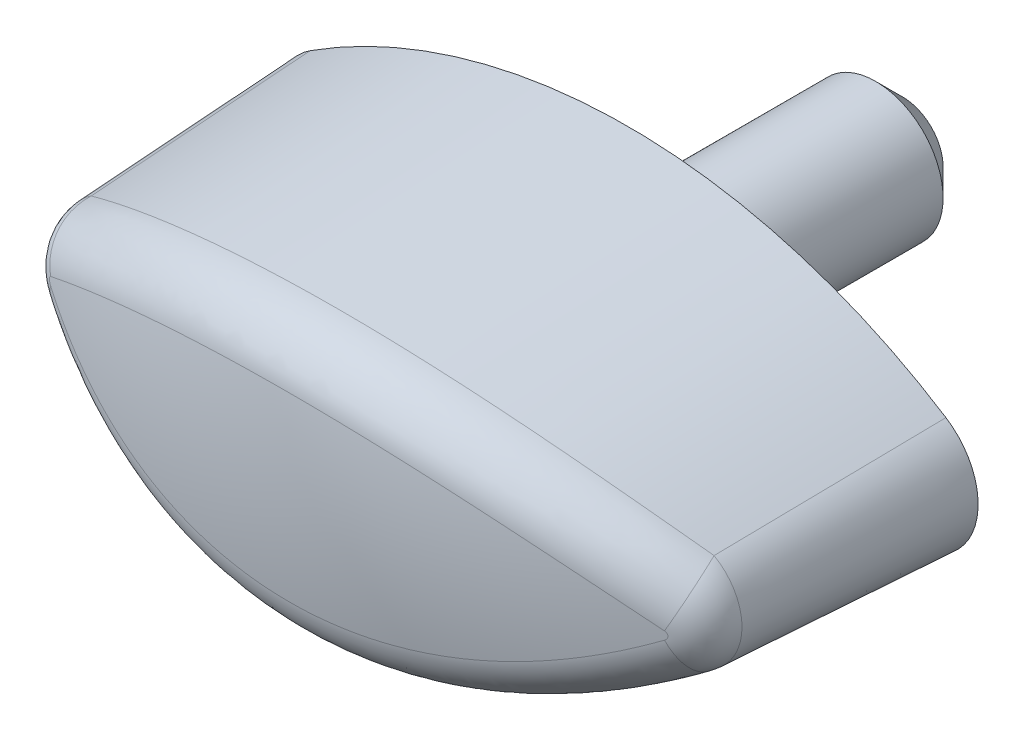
ISO-10303-21;
HEADER;
FILE_DESCRIPTION(('STEP AP214'),'2;1');
FILE_NAME('part.step','',(''),(''),'','','');
FILE_SCHEMA(('AUTOMOTIVE_DESIGN { 1 0 10303 214 1 1 1 1 }'));
ENDSEC;
DATA;
#1=APPLICATION_CONTEXT('core data for automotive mechanical design processes');
#2=APPLICATION_PROTOCOL_DEFINITION('international standard','automotive_design',2000,#1);
#3=PRODUCT_CONTEXT('',#1,'mechanical');
#4=PRODUCT('Part','Part','',(#3));
#5=PRODUCT_RELATED_PRODUCT_CATEGORY('part','',(#4));
#6=PRODUCT_DEFINITION_FORMATION('','',#4);
#7=PRODUCT_DEFINITION_CONTEXT('part definition',#1,'design');
#8=PRODUCT_DEFINITION('design','',#6,#7);
#9=PRODUCT_DEFINITION_SHAPE('','',#8);
#10=(LENGTH_UNIT() NAMED_UNIT(*) SI_UNIT(.MILLI.,.METRE.));
#11=(NAMED_UNIT(*) PLANE_ANGLE_UNIT() SI_UNIT($,.RADIAN.));
#12=(NAMED_UNIT(*) SI_UNIT($,.STERADIAN.) SOLID_ANGLE_UNIT());
#13=UNCERTAINTY_MEASURE_WITH_UNIT(LENGTH_MEASURE(1.E-05),#10,'distance_accuracy_value','');
#14=(GEOMETRIC_REPRESENTATION_CONTEXT(3) GLOBAL_UNCERTAINTY_ASSIGNED_CONTEXT((#13)) GLOBAL_UNIT_ASSIGNED_CONTEXT((#10,
#11,#12)) REPRESENTATION_CONTEXT('',''));
#15=CARTESIAN_POINT('',(0.,0.,0.));
#16=DIRECTION('',(0.,0.,1.));
#17=DIRECTION('',(1.,0.,0.));
#18=AXIS2_PLACEMENT_3D('',#15,#16,#17);
#19=CARTESIAN_POINT('',(0.,16.2061475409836,0.2));
#20=DIRECTION('',(0.,0.,-1.));
#21=DIRECTION('',(1.,0.,0.));
#22=AXIS2_PLACEMENT_3D('',#19,#20,#21);
#23=CONICAL_SURFACE('',#22,21.8561475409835,0.05235987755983);
#24=DIRECTION('',(0.0282659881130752,-0.044046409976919,-0.998629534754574));
#25=VECTOR('',#24,1.);
#26=CARTESIAN_POINT('',(11.8042271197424,-2.18818330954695,0.2));
#27=LINE('',#26,#25);
#28=CARTESIAN_POINT('',(11.5672178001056,-1.81885570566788,8.57347364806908));
#29=VERTEX_POINT('',#28);
#30=CARTESIAN_POINT('',(11.8042271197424,-2.18818330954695,0.2));
#31=VERTEX_POINT('',#30);
#32=EDGE_CURVE('E67',#29,#31,#27,.T.);
#33=ORIENTED_EDGE('',*,*,#32,.F.);
#34=CARTESIAN_POINT('',(16.4271005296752,4.04077128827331,6.40713273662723));
#35=CARTESIAN_POINT('',(17.0926019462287,3.05918648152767,6.02869797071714));
#36=CARTESIAN_POINT('',(16.6525406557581,2.44524763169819,5.03923403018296));
#37=CARTESIAN_POINT('',(16.2585809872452,3.85260775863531,6.59883012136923));
#38=CARTESIAN_POINT('',(16.926208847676,2.85960111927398,6.22100494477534));
#39=CARTESIAN_POINT('',(16.4824342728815,2.25390206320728,5.21559562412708));
#40=CARTESIAN_POINT('',(16.08502906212,3.66508667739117,6.78668348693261));
#41=CARTESIAN_POINT('',(16.7547344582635,2.66078768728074,6.40930934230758));
#42=CARTESIAN_POINT('',(16.3071905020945,2.06319388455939,5.38842072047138));
#43=CARTESIAN_POINT('',(15.7277470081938,3.29210943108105,7.15464886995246));
#44=CARTESIAN_POINT('',(16.4007505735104,2.26460172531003,6.77876476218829));
#45=CARTESIAN_POINT('',(15.9463115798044,1.68384716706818,5.7269488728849));
#46=CARTESIAN_POINT('',(15.5440159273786,3.10665346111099,7.33476016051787));
#47=CARTESIAN_POINT('',(16.218192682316,2.06723845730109,6.95988042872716));
#48=CARTESIAN_POINT('',(15.7606754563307,1.49520882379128,5.89265126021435));
#49=CARTESIAN_POINT('',(14.9771469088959,2.55432799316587,7.86361459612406));
#50=CARTESIAN_POINT('',(15.65212864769,1.4769888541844,7.49378323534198));
#51=CARTESIAN_POINT('',(15.1877641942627,0.933361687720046,6.37919734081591));
#52=CARTESIAN_POINT('',(14.5785877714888,2.19178794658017,8.20058814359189));
#53=CARTESIAN_POINT('',(15.2527614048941,1.08900357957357,7.83420074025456));
#54=CARTESIAN_POINT('',(14.784743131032,0.564512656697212,6.68921300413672));
#55=CARTESIAN_POINT('',(13.7396705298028,1.48408133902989,8.84285513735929));
#56=CARTESIAN_POINT('',(14.4076445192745,0.328451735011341,8.48548173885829));
#57=CARTESIAN_POINT('',(13.9360201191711,-0.155612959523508,7.28009863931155));
#58=CARTESIAN_POINT('',(13.299189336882,1.1389707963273,9.14804941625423));
#59=CARTESIAN_POINT('',(13.9614980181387,-0.0437819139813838,8.79586274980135));
#60=CARTESIAN_POINT('',(13.4901924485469,-0.506832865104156,7.56087737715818));
#61=CARTESIAN_POINT('',(12.3788396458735,0.474007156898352,9.72428583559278));
#62=CARTESIAN_POINT('',(13.0244079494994,-0.76414692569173,9.38421171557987));
#63=CARTESIAN_POINT('',(12.5582956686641,-1.18365619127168,8.09101488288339));
#64=CARTESIAN_POINT('',(11.8989905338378,0.154141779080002,9.99534462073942));
#65=CARTESIAN_POINT('',(12.5333362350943,-1.11189744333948,9.66176439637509));
#66=CARTESIAN_POINT('',(12.0722463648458,-1.50927206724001,8.34038896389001));
#67=CARTESIAN_POINT('',(10.9918679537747,-0.399283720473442,10.4564446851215));
#68=CARTESIAN_POINT('',(11.6009373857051,-1.71581007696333,10.1354756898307));
#69=CARTESIAN_POINT('',(11.1530988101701,-2.07271157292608,8.7646010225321));
#70=CARTESIAN_POINT('',(10.5706790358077,-0.638014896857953,10.6522866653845));
#71=CARTESIAN_POINT('',(11.1660220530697,-1.97724702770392,10.3372887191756));
#72=CARTESIAN_POINT('',(10.7262184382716,-2.31578759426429,8.94477564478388));
#73=CARTESIAN_POINT('',(9.70506863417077,-1.0909288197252,11.0194202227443));
#74=CARTESIAN_POINT('',(10.2686487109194,-2.47499013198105,10.7168267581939));
#75=CARTESIAN_POINT('',(9.84871220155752,-2.77698301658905,9.2825385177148));
#76=CARTESIAN_POINT('',(9.26065066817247,-1.30511526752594,11.1907155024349));
#77=CARTESIAN_POINT('',(9.80629346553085,-2.71099502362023,10.8942922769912));
#78=CARTESIAN_POINT('',(9.39808993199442,-2.99510618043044,9.44013017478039));
#79=CARTESIAN_POINT('',(8.35164218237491,-1.70545052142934,11.5077173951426));
#80=CARTESIAN_POINT('',(8.85709456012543,-3.15360413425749,11.2237259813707));
#81=CARTESIAN_POINT('',(8.47621761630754,-3.40282884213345,9.73177191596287));
#82=CARTESIAN_POINT('',(7.88709122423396,-1.89165136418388,11.6534715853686));
#83=CARTESIAN_POINT('',(8.37049092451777,-3.35994623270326,11.3754857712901));
#84=CARTESIAN_POINT('',(8.00500801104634,-3.59248127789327,9.86586577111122));
#85=CARTESIAN_POINT('',(6.93972810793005,-2.23368053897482,11.9190737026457));
#86=CARTESIAN_POINT('',(7.37482487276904,-3.74016648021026,11.6528309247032));
#87=CARTESIAN_POINT('',(7.04391934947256,-3.94087129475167,10.1102197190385));
#88=CARTESIAN_POINT('',(6.45691596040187,-2.38950888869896,12.0389216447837));
#89=CARTESIAN_POINT('',(6.86606148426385,-3.91373154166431,11.778175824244));
#90=CARTESIAN_POINT('',(6.55404030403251,-4.09960889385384,10.2204798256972));
#91=CARTESIAN_POINT('',(5.47422718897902,-2.66889743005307,12.2524891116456));
#92=CARTESIAN_POINT('',(5.82751619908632,-4.22580082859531,12.0021233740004));
#93=CARTESIAN_POINT('',(5.55684925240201,-4.38422670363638,10.4169618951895));
#94=CARTESIAN_POINT('',(4.97429072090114,-2.7923278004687,12.3461036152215));
#95=CARTESIAN_POINT('',(5.29806954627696,-4.36387330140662,12.1004035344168));
#96=CARTESIAN_POINT('',(5.04947605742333,-4.50997472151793,10.5030872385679));
#97=CARTESIAN_POINT('',(3.96272978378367,-3.00409931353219,12.5060314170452));
#98=CARTESIAN_POINT('',(4.2242075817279,-4.60133740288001,12.2686804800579));
#99=CARTESIAN_POINT('',(4.02277805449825,-4.72572979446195,10.6502208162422));
#100=CARTESIAN_POINT('',(3.45110519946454,-3.0924401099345,12.5723444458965));
#101=CARTESIAN_POINT('',(3.68028447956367,-4.70049066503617,12.3385056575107));
#102=CARTESIAN_POINT('',(3.50345312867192,-4.8157364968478,10.7112288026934));
#103=CARTESIAN_POINT('',(2.41973997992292,-3.23260047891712,12.6772955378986));
#104=CARTESIAN_POINT('',(2.5818111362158,-4.85810549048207,12.4492154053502));
#105=CARTESIAN_POINT('',(2.45650599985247,-4.95854272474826,10.8077838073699));
#106=CARTESIAN_POINT('',(1.89999456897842,-3.28439766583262,12.7159166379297));
#107=CARTESIAN_POINT('',(2.02781849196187,-4.91637456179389,12.4899638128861));
#108=CARTESIAN_POINT('',(1.92887891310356,-5.011319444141,10.8433152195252));
#109=CARTESIAN_POINT('',(0.856813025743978,-3.35050150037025,12.7651719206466));
#110=CARTESIAN_POINT('',(0.91460255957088,-4.99083732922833,12.5420003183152));
#111=CARTESIAN_POINT('',(0.869850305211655,-5.07867371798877,10.8886300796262));
#112=CARTESIAN_POINT('',(0.333377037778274,-3.36480960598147,12.7758071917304));
#113=CARTESIAN_POINT('',(0.355986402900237,-5.00695089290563,12.5532323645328));
#114=CARTESIAN_POINT('',(0.338448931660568,-5.09325275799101,10.898414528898));
#115=CARTESIAN_POINT('',(-0.687903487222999,-3.35591787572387,12.769190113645));
#116=CARTESIAN_POINT('',(-0.734449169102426,-4.99692946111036,12.5462382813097));
#117=CARTESIAN_POINT('',(-0.698369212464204,-5.08419274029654,10.8923268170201));
#118=CARTESIAN_POINT('',(-1.18577326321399,-3.33448127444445,12.7532487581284));
#119=CARTESIAN_POINT('',(-1.26571963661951,-4.97279015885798,12.529403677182));
#120=CARTESIAN_POINT('',(-1.20381178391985,-5.06235030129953,10.877660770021));
#121=CARTESIAN_POINT('',(-2.17741077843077,-3.25774611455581,12.6960336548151));
#122=CARTESIAN_POINT('',(-2.32364698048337,-4.88637248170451,12.4689708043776));
#123=CARTESIAN_POINT('',(-2.21050207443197,-4.98416400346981,10.8250228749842));
#124=CARTESIAN_POINT('',(-2.67117868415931,-3.20244893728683,12.6547609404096));
#125=CARTESIAN_POINT('',(-2.84978564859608,-4.82418127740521,12.4254336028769));
#126=CARTESIAN_POINT('',(-2.71174996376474,-4.92782155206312,10.7870519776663));
#127=CARTESIAN_POINT('',(-3.65072386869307,-3.05889693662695,12.5471607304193));
#128=CARTESIAN_POINT('',(-3.89265326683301,-4.66280856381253,12.3119643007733));
#129=CARTESIAN_POINT('',(-3.70607731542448,-4.78156081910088,10.6880597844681));
#130=CARTESIAN_POINT('',(-4.13650708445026,-2.97066787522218,12.4808528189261));
#131=CARTESIAN_POINT('',(-4.40891081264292,-4.56381017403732,12.2421620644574));
#132=CARTESIAN_POINT('',(-4.19916284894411,-4.69166878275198,10.627056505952));
#133=CARTESIAN_POINT('',(-5.09717290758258,-2.76257685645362,12.3235430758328));
#134=CARTESIAN_POINT('',(-5.42834711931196,-4.33055204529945,12.076689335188));
#135=CARTESIAN_POINT('',(-5.17418741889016,-4.47966509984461,10.4823315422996));
#136=CARTESIAN_POINT('',(-5.57205517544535,-2.64271391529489,12.23254047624));
#137=CARTESIAN_POINT('',(-5.93110791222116,-4.19650152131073,11.9811697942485));
#138=CARTESIAN_POINT('',(-5.65612610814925,-4.35755245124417,10.39860915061));
#139=CARTESIAN_POINT('',(-6.52342620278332,-2.36863314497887,12.0228841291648));
#140=CARTESIAN_POINT('',(-6.93622900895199,-3.89045001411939,11.7613818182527));
#141=CARTESIAN_POINT('',(-6.62152588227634,-4.07834322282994,10.2057253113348));
#142=CARTESIAN_POINT('',(-6.99944348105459,-2.21340563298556,11.9034116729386));
#143=CARTESIAN_POINT('',(-7.43771431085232,-3.71758760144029,11.6364504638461));
#144=CARTESIAN_POINT('',(-7.1045048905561,-3.92021853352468,10.0958106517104));
#145=CARTESIAN_POINT('',(-7.93357302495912,-1.87343069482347,11.6392301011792));
#146=CARTESIAN_POINT('',(-8.4192497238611,-3.33972387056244,11.3606353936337));
#147=CARTESIAN_POINT('',(-8.05215764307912,-3.57392264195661,9.85276360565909));
#148=CARTESIAN_POINT('',(-8.39168486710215,-1.68868257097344,11.4945203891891));
#149=CARTESIAN_POINT('',(-8.89901518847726,-3.13502380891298,11.2099834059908));
#150=CARTESIAN_POINT('',(-8.51683095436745,-3.38575072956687,9.71963067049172));
#151=CARTESIAN_POINT('',(-9.28832878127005,-1.29198854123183,11.1802342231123));
#152=CARTESIAN_POINT('',(-9.83514248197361,-2.69650353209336,10.8834130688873));
#153=CARTESIAN_POINT('',(-9.4261554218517,-2.981738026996,9.43048739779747));
#154=CARTESIAN_POINT('',(-9.72681941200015,-1.07998842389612,11.010608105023));
#155=CARTESIAN_POINT('',(-10.2912719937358,-2.46293111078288,10.7076916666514));
#156=CARTESIAN_POINT('',(-9.87076421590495,-2.76584208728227,9.27443136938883));
#157=CARTESIAN_POINT('',(-10.5811244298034,-0.63209213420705,10.647427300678));
#158=CARTESIAN_POINT('',(-11.1768417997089,-1.9707403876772,10.3322652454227));
#159=CARTESIAN_POINT('',(-10.7368049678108,-2.30975704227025,8.94030502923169));
#160=CARTESIAN_POINT('',(-10.9969353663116,-0.396192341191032,10.4538689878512));
#161=CARTESIAN_POINT('',(-11.6061841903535,-1.71241191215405,10.1328101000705));
#162=CARTESIAN_POINT('',(-11.1582333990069,-2.06956425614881,8.76223138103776));
#163=CARTESIAN_POINT('',(-11.8989748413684,0.154132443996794,9.99535244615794));
#164=CARTESIAN_POINT('',(-12.5333203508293,-1.11190751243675,9.66177236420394));
#165=CARTESIAN_POINT('',(-12.0722304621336,-1.50928157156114,8.34039616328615));
#166=CARTESIAN_POINT('',(-12.3788134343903,0.473989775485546,9.72430057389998));
#167=CARTESIAN_POINT('',(-13.0243812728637,-0.764165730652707,9.38422673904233));
#168=CARTESIAN_POINT('',(-12.5582691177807,-1.18367388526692,8.0910284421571));
#169=CARTESIAN_POINT('',(-13.2991488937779,1.13894001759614,9.14807641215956));
#170=CARTESIAN_POINT('',(-13.9614569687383,-0.0438151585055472,8.79589023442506));
#171=CARTESIAN_POINT('',(-13.490151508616,-0.50686419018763,7.56090221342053));
#172=CARTESIAN_POINT('',(-13.7396257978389,1.48404557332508,8.84288698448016));
#173=CARTESIAN_POINT('',(-14.4075993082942,0.328413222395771,8.48551407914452));
#174=CARTESIAN_POINT('',(-13.935974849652,-0.15564935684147,7.2801279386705));
#175=CARTESIAN_POINT('',(-14.5785517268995,2.19175557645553,8.20061812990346));
#176=CARTESIAN_POINT('',(-15.2527251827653,1.08896883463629,7.83423112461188));
#177=CARTESIAN_POINT('',(-14.7847066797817,0.564479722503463,6.68924059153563));
#178=CARTESIAN_POINT('',(-14.9771223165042,2.55430469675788,7.86363664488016));
#179=CARTESIAN_POINT('',(-15.6521040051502,1.47696388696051,7.49380555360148));
#180=CARTESIAN_POINT('',(-15.1877393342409,0.933337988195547,6.37921762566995));
#181=CARTESIAN_POINT('',(-15.5440042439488,3.10664174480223,7.33477150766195));
#182=CARTESIAN_POINT('',(-16.2181810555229,2.06722597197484,6.95989185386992));
#183=CARTESIAN_POINT('',(-15.7606636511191,1.49519690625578,5.89266169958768));
#184=CARTESIAN_POINT('',(-15.7277377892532,3.29209996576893,7.15465813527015));
#185=CARTESIAN_POINT('',(-16.4007414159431,2.26459165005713,6.7787740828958));
#186=CARTESIAN_POINT('',(-15.9463022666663,1.68383753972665,5.72695739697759));
#187=CARTESIAN_POINT('',(-16.085024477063,3.66508173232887,6.78668843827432));
#188=CARTESIAN_POINT('',(-16.7547299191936,2.66078243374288,6.40931431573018));
#189=CARTESIAN_POINT('',(-16.3071858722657,2.06318885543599,5.38842527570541));
#190=CARTESIAN_POINT('',(-16.2585785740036,3.85260508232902,6.59883284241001));
#191=CARTESIAN_POINT('',(-16.9262064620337,2.85959827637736,6.22100767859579));
#192=CARTESIAN_POINT('',(-16.4824318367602,2.25389934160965,5.21559812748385));
#193=CARTESIAN_POINT('',(-16.4271001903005,4.04077090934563,6.40713312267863));
#194=CARTESIAN_POINT('',(-17.0926016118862,3.05918608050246,6.02869835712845));
#195=CARTESIAN_POINT('',(-16.6525403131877,2.44524724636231,5.03923438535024));
#196=(BOUNDED_SURFACE() B_SPLINE_SURFACE(3,2,((#34,#35,#36),(#37,#38,#39),(#40,#41,#42),(#43,
#44,#45),(#46,#47,#48),(#49,#50,#51),(#52,#53,#54),(#55,#56,#57),(#58,#59,#60),(#61,#62,#63),
(#64,#65,#66),(#67,#68,#69),(#70,#71,#72),(#73,#74,#75),(#76,#77,#78),(#79,#80,#81),(#82,#83,
#84),(#85,#86,#87),(#88,#89,#90),(#91,#92,#93),(#94,#95,#96),(#97,#98,#99),(#100,#101,#102),
(#103,#104,#105),(#106,#107,#108),(#109,#110,#111),(#112,#113,#114),(#115,#116,#117),(#118,#119,
#120),(#121,#122,#123),(#124,#125,#126),(#127,#128,#129),(#130,#131,#132),(#133,#134,#135),
(#136,#137,#138),(#139,#140,#141),(#142,#143,#144),(#145,#146,#147),(#148,#149,#150),(#151,#152,
#153),(#154,#155,#156),(#157,#158,#159),(#160,#161,#162),(#163,#164,#165),(#166,#167,#168),
(#169,#170,#171),(#172,#173,#174),(#175,#176,#177),(#178,#179,#180),(#181,#182,#183),(#184,#185,
#186),(#187,#188,#189),(#190,#191,#192),(#193,#194,#195)),.UNSPECIFIED.,.F.,.F.,
.F.) B_SPLINE_SURFACE_WITH_KNOTS((4,2,2,2,2,2,2,2,2,2,2,2,2,2,2,2,2,2,2,2,2,2,2,2,2,2,4),(3,3),
(0.,0.875075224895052,1.7502324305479,3.50187037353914,5.25882008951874,7.01490975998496,
8.45488787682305,9.89464856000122,11.33169810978,12.7687468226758,14.2114689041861,
15.6542052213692,17.097824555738,18.5413877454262,19.9158269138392,21.2902100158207,
22.6635202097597,24.0368731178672,25.4558847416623,26.8749299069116,28.2968429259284,
29.7189716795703,31.4750152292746,33.2319443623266,34.9836274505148,35.858795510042,
36.7338813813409),(0.,1.),
.UNSPECIFIED.) GEOMETRIC_REPRESENTATION_ITEM() RATIONAL_B_SPLINE_SURFACE(((1.,0.848982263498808,
1.),(1.,0.84709050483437,1.),(1.,0.845197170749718,1.),(1.,0.841415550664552,1.),(1.,
0.839527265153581,1.),(1.,0.833879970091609,1.),(1.,0.830141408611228,1.),(1.,0.82278429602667,
1.),(1.,0.819166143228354,1.),(1.,0.812141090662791,1.),(1.,0.80873408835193,1.),(1.,
0.802797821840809,1.),(1.,0.800220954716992,1.),(1.,0.795306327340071,1.),(1.,0.792968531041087,
1.),(1.,0.788578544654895,1.),(1.,0.786525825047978,1.),(1.,0.782740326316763,1.),(1.,
0.781007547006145,1.),(1.,0.777891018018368,1.),(1.,0.776508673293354,1.),(1.,0.774131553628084,
1.),(1.,0.773136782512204,1.),(1.,0.77155636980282,1.),(1.,0.770970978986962,1.),(1.,
0.770223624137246,1.),(1.,0.770061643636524,1.),(1.,0.770162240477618,1.),(1.,0.770404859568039,
1.),(1.,0.771272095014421,1.),(1.,0.771896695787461,1.),(1.,0.773514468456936,1.),(1.,
0.774507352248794,1.),(1.,0.77684190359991,1.),(1.,0.778183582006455,1.),(1.,0.781239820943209,
1.),(1.,0.782965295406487,1.),(1.,0.786726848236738,1.),(1.,0.788762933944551,1.),(1.,
0.793111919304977,1.),(1.,0.79542537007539,1.),(1.,0.800284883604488,1.),(1.,0.802830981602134,
1.),(1.,0.808733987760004,1.),(1.,0.812140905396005,1.),(1.,0.819165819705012,1.),(1.,
0.822783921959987,1.),(1.,0.830141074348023,1.),(1.,0.83387973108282,1.),(1.,0.839527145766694,
1.),(1.,0.841415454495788,1.),(1.,0.845197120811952,1.),(1.,0.847090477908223,1.),(1.,
0.848982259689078,1.))) REPRESENTATION_ITEM('') SURFACE());
#197=CARTESIAN_POINT('',(16.6525406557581,2.44524763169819,5.03923403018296));
#198=CARTESIAN_POINT('',(16.4824342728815,2.25390206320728,5.21559562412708));
#199=CARTESIAN_POINT('',(16.3071905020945,2.06319388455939,5.38842072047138));
#200=CARTESIAN_POINT('',(15.9463115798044,1.68384716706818,5.7269488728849));
#201=CARTESIAN_POINT('',(15.7606754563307,1.49520882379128,5.89265126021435));
#202=CARTESIAN_POINT('',(15.1877641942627,0.933361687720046,6.37919734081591));
#203=CARTESIAN_POINT('',(14.784743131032,0.564512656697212,6.68921300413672));
#204=CARTESIAN_POINT('',(13.9360201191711,-0.155612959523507,7.28009863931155));
#205=CARTESIAN_POINT('',(13.4901924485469,-0.506832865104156,7.56087737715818));
#206=CARTESIAN_POINT('',(12.5582956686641,-1.18365619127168,8.09101488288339));
#207=CARTESIAN_POINT('',(12.0722463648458,-1.50927206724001,8.34038896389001));
#208=CARTESIAN_POINT('',(11.1530988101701,-2.07271157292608,8.7646010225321));
#209=CARTESIAN_POINT('',(10.7262184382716,-2.31578759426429,8.94477564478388));
#210=CARTESIAN_POINT('',(9.84871220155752,-2.77698301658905,9.2825385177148));
#211=CARTESIAN_POINT('',(9.39808993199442,-2.99510618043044,9.44013017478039));
#212=CARTESIAN_POINT('',(8.47621761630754,-3.40282884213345,9.73177191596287));
#213=CARTESIAN_POINT('',(8.00500801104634,-3.59248127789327,9.86586577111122));
#214=CARTESIAN_POINT('',(7.04391934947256,-3.94087129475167,10.1102197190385));
#215=CARTESIAN_POINT('',(6.55404030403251,-4.09960889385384,10.2204798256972));
#216=CARTESIAN_POINT('',(5.55684925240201,-4.38422670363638,10.4169618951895));
#217=CARTESIAN_POINT('',(5.04947605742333,-4.50997472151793,10.5030872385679));
#218=CARTESIAN_POINT('',(4.02277805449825,-4.72572979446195,10.6502208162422));
#219=CARTESIAN_POINT('',(3.50345312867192,-4.8157364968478,10.7112288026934));
#220=CARTESIAN_POINT('',(2.45650599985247,-4.95854272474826,10.8077838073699));
#221=CARTESIAN_POINT('',(1.92887891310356,-5.011319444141,10.8433152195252));
#222=CARTESIAN_POINT('',(0.869850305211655,-5.07867371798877,10.8886300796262));
#223=CARTESIAN_POINT('',(0.33844893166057,-5.09325275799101,10.898414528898));
#224=CARTESIAN_POINT('',(-0.698369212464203,-5.08419274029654,10.8923268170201));
#225=CARTESIAN_POINT('',(-1.20381178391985,-5.06235030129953,10.877660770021));
#226=CARTESIAN_POINT('',(-2.21050207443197,-4.98416400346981,10.8250228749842));
#227=CARTESIAN_POINT('',(-2.71174996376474,-4.92782155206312,10.7870519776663));
#228=CARTESIAN_POINT('',(-3.70607731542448,-4.78156081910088,10.6880597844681));
#229=CARTESIAN_POINT('',(-4.19916284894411,-4.69166878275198,10.627056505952));
#230=CARTESIAN_POINT('',(-5.17418741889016,-4.47966509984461,10.4823315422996));
#231=CARTESIAN_POINT('',(-5.65612610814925,-4.35755245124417,10.39860915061));
#232=CARTESIAN_POINT('',(-6.62152588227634,-4.07834322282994,10.2057253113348));
#233=CARTESIAN_POINT('',(-7.1045048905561,-3.92021853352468,10.0958106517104));
#234=CARTESIAN_POINT('',(-8.05215764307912,-3.57392264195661,9.85276360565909));
#235=CARTESIAN_POINT('',(-8.51683095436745,-3.38575072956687,9.71963067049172));
#236=CARTESIAN_POINT('',(-9.4261554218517,-2.981738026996,9.43048739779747));
#237=CARTESIAN_POINT('',(-9.87076421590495,-2.76584208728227,9.27443136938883));
#238=CARTESIAN_POINT('',(-10.7368049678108,-2.30975704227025,8.94030502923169));
#239=CARTESIAN_POINT('',(-11.1582333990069,-2.06956425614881,8.76223138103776));
#240=CARTESIAN_POINT('',(-12.0722304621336,-1.50928157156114,8.34039616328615));
#241=CARTESIAN_POINT('',(-12.5582691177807,-1.18367388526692,8.0910284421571));
#242=CARTESIAN_POINT('',(-13.490151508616,-0.50686419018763,7.56090221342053));
#243=CARTESIAN_POINT('',(-13.935974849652,-0.15564935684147,7.2801279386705));
#244=CARTESIAN_POINT('',(-14.7847066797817,0.564479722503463,6.68924059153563));
#245=CARTESIAN_POINT('',(-15.1877393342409,0.933337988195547,6.37921762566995));
#246=CARTESIAN_POINT('',(-15.7606636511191,1.49519690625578,5.89266169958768));
#247=CARTESIAN_POINT('',(-15.9463022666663,1.68383753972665,5.72695739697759));
#248=CARTESIAN_POINT('',(-16.3071858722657,2.06318885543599,5.38842527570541));
#249=CARTESIAN_POINT('',(-16.4824318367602,2.25389934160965,5.21559812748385));
#250=CARTESIAN_POINT('',(-16.6525403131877,2.44524724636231,5.03923438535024));
#251=B_SPLINE_CURVE_WITH_KNOTS('',3,(#197,#198,#199,#200,#201,#202,#203,#204,#205,#206,#207,
#208,#209,#210,#211,#212,#213,#214,#215,#216,#217,#218,#219,#220,#221,#222,#223,#224,#225,#226,
#227,#228,#229,#230,#231,#232,#233,#234,#235,#236,#237,#238,#239,#240,#241,#242,#243,#244,#245,
#246,#247,#248,#249,#250),.UNSPECIFIED.,.F.,.F.,(4,2,2,2,2,2,2,2,2,2,2,2,2,2,2,2,2,2,2,2,2,2,2,
2,2,2,4),(0.,0.875075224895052,1.7502324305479,3.50187037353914,5.25882008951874,
7.01490975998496,8.45488787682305,9.89464856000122,11.33169810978,12.7687468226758,
14.2114689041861,15.6542052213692,17.097824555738,18.5413877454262,19.9158269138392,
21.2902100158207,22.6635202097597,24.0368731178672,25.4558847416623,26.8749299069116,
28.2968429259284,29.7189716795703,31.4750152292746,33.2319443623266,34.9836274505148,
35.858795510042,36.7338813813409),.UNSPECIFIED.);
#252=CARTESIAN_POINT('',(-11.5672173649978,-1.81885597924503,8.57347373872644));
#253=VERTEX_POINT('',#252);
#254=EDGE_CURVE('E30',#29,#253,#251,.T.);
#255=ORIENTED_EDGE('',*,*,#254,.T.);
#256=DIRECTION('',(-0.0282659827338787,-0.0440464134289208,-0.998629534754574));
#257=VECTOR('',#256,1.);
#258=CARTESIAN_POINT('',(-11.8042266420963,-2.18818361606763,0.2));
#259=LINE('',#258,#257);
#260=CARTESIAN_POINT('',(-11.8042266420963,-2.18818361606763,0.2));
#261=VERTEX_POINT('',#260);
#262=EDGE_CURVE('E85',#253,#261,#259,.T.);
#263=ORIENTED_EDGE('',*,*,#262,.T.);
#264=CARTESIAN_POINT('',(0.,16.2061475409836,0.2));
#265=DIRECTION('',(0.,0.,1.));
#266=DIRECTION('',(1.,0.,0.));
#267=AXIS2_PLACEMENT_3D('',#264,#265,#266);
#268=CIRCLE('',#267,21.8561475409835);
#269=EDGE_CURVE('E81',#261,#31,#268,.T.);
#270=ORIENTED_EDGE('',*,*,#269,.T.);
#271=EDGE_LOOP('',(#33,#255,#263,#270));
#272=FACE_BOUND('',#271,.T.);
#273=ADVANCED_FACE('F14',(#272),#23,.T.);
#274=CARTESIAN_POINT('',(10.4,0.,0.2));
#275=DIRECTION('',(0.,0.,-1.));
#276=DIRECTION('',(1.,0.,0.));
#277=AXIS2_PLACEMENT_3D('',#274,#275,#276);
#278=CONICAL_SURFACE('',#277,2.6,0.05235987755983);
#279=DIRECTION('',(0.0282659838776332,0.0440464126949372,-0.998629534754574));
#280=VECTOR('',#279,1.);
#281=CARTESIAN_POINT('',(11.8042271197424,2.18818330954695,0.2));
#282=LINE('',#281,#280);
#283=CARTESIAN_POINT('',(11.5672178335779,1.81885567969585,8.57347372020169));
#284=VERTEX_POINT('',#283);
#285=CARTESIAN_POINT('',(11.8042271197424,2.18818330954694,0.2));
#286=VERTEX_POINT('',#285);
#287=EDGE_CURVE('E74',#284,#286,#282,.T.);
#288=ORIENTED_EDGE('',*,*,#287,.F.);
#289=CARTESIAN_POINT('',(11.3400690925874,0.172896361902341,10.2794286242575));
#290=CARTESIAN_POINT('',(11.5780599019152,1.87931271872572,10.1450506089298));
#291=CARTESIAN_POINT('',(10.8369727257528,2.11501444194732,8.60174624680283));
#292=CARTESIAN_POINT('',(11.3506112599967,0.17101013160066,10.2740774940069));
#293=CARTESIAN_POINT('',(11.6642783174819,1.81641301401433,10.1016539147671));
#294=CARTESIAN_POINT('',(10.9653127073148,2.08881990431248,8.59682320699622));
#295=CARTESIAN_POINT('',(11.3610262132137,0.168141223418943,10.2687888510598));
#296=CARTESIAN_POINT('',(11.744830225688,1.74757226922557,10.0611041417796));
#297=CARTESIAN_POINT('',(11.0914965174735,2.05078298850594,8.59195765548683));
#298=CARTESIAN_POINT('',(11.3813028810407,0.160477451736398,10.2584890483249));
#299=CARTESIAN_POINT('',(11.8928044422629,1.60137455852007,9.98660547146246));
#300=CARTESIAN_POINT('',(11.3361678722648,1.95181480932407,8.58248183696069));
#301=CARTESIAN_POINT('',(11.3911631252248,0.155677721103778,10.2534786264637));
#302=CARTESIAN_POINT('',(11.9606185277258,1.52401777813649,9.95245949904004));
#303=CARTESIAN_POINT('',(11.4546350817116,1.89082571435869,8.57787224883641));
#304=CARTESIAN_POINT('',(11.4088520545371,0.144886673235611,10.2444872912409));
#305=CARTESIAN_POINT('',(12.0764993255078,1.37214420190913,9.89410390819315));
#306=CARTESIAN_POINT('',(11.6663621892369,1.7554763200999,8.56960022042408));
#307=CARTESIAN_POINT('',(11.4167827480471,0.139105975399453,10.2404548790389));
#308=CARTESIAN_POINT('',(12.1261163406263,1.29848252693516,9.86911459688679));
#309=CARTESIAN_POINT('',(11.7609430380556,1.68358103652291,8.56589040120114));
#310=CARTESIAN_POINT('',(11.4316870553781,0.126168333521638,10.2328748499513));
#311=CARTESIAN_POINT('',(12.2159872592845,1.14686018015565,9.82384714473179));
#312=CARTESIAN_POINT('',(11.9381750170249,1.52386035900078,8.55891677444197));
#313=CARTESIAN_POINT('',(11.4386617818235,0.119013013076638,10.2293266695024));
#314=CARTESIAN_POINT('',(12.2564694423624,1.06880763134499,9.80345409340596));
#315=CARTESIAN_POINT('',(12.0208400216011,1.43605376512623,8.55565244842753));
#316=CARTESIAN_POINT('',(11.4514345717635,0.103406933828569,10.2228275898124));
#317=CARTESIAN_POINT('',(12.3284346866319,0.908629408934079,9.76719813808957));
#318=CARTESIAN_POINT('',(12.1718602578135,1.24554657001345,8.54967329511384));
#319=CARTESIAN_POINT('',(11.4572262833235,0.0949495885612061,10.2198799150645));
#320=CARTESIAN_POINT('',(12.3600595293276,0.826331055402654,9.75126382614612));
#321=CARTESIAN_POINT('',(12.2401383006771,1.14277039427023,8.54696143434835));
#322=CARTESIAN_POINT('',(11.4673165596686,0.0769732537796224,10.2147437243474));
#323=CARTESIAN_POINT('',(12.4139453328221,0.65881478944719,9.72411135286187));
#324=CARTESIAN_POINT('',(12.3588786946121,0.925121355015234,8.5422361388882));
#325=CARTESIAN_POINT('',(11.4716155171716,0.0674545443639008,10.2125550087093));
#326=CARTESIAN_POINT('',(12.436359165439,0.573401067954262,9.7128161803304));
#327=CARTESIAN_POINT('',(12.4093457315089,0.810251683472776,8.54022252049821));
#328=CARTESIAN_POINT('',(11.4781806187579,0.0485336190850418,10.2092122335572));
#329=CARTESIAN_POINT('',(12.4701103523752,0.408222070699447,9.69580694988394));
#330=CARTESIAN_POINT('',(12.4863326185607,0.582446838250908,8.5371471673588));
#331=CARTESIAN_POINT('',(11.480592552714,0.0391951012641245,10.2079839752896));
#332=CARTESIAN_POINT('',(12.4823261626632,0.328469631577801,9.68965027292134));
#333=CARTESIAN_POINT('',(12.514571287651,0.470233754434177,8.53601716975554));
#334=CARTESIAN_POINT('',(11.4838532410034,0.0201820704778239,10.2063234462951));
#335=CARTESIAN_POINT('',(12.4987378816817,0.168216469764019,9.68137876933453));
#336=CARTESIAN_POINT('',(12.5527336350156,0.242009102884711,8.53448948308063));
#337=CARTESIAN_POINT('',(11.4847029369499,0.010507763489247,10.205890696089));
#338=CARTESIAN_POINT('',(12.5029806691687,0.087514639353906,9.679240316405));
#339=CARTESIAN_POINT('',(12.5626683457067,0.125999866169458,8.53409135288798));
#340=CARTESIAN_POINT('',(11.4847915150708,-0.00810013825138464,10.205845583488));
#341=CARTESIAN_POINT('',(12.5034227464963,-0.0674578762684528,9.67901750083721));
#342=CARTESIAN_POINT('',(12.5637040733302,-0.0971297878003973,8.53404984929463));
#343=CARTESIAN_POINT('',(11.4841496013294,-0.0170333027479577,10.2061725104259));
#344=CARTESIAN_POINT('',(12.5002185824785,-0.141915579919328,9.6806324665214));
#345=CARTESIAN_POINT('',(12.5561988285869,-0.204245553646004,8.53435062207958));
#346=CARTESIAN_POINT('',(11.4815287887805,-0.0346471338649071,10.2075071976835));
#347=CARTESIAN_POINT('',(12.4870513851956,-0.289940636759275,9.68726877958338));
#348=CARTESIAN_POINT('',(12.5255307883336,-0.415620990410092,8.53557853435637));
#349=CARTESIAN_POINT('',(11.479550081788,-0.0433278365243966,10.2085148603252));
#350=CARTESIAN_POINT('',(12.4770605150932,-0.363667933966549,9.69230415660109));
#351=CARTESIAN_POINT('',(12.5023702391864,-0.519881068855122,8.5365055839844));
#352=CARTESIAN_POINT('',(11.4743596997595,-0.0601529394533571,10.2111577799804));
#353=CARTESIAN_POINT('',(12.4505320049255,-0.509143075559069,9.70567373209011));
#354=CARTESIAN_POINT('',(12.441535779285,-0.722288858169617,8.53893707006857));
#355=CARTESIAN_POINT('',(11.4711551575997,-0.0683001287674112,10.2127894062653));
#356=CARTESIAN_POINT('',(12.4339763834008,-0.581045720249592,9.71401699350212));
#357=CARTESIAN_POINT('',(12.4039458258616,-0.820468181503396,8.54043816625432));
#358=CARTESIAN_POINT('',(11.4636400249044,-0.0839260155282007,10.2166152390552));
#359=CARTESIAN_POINT('',(12.3944606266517,-0.722801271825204,9.7339296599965));
#360=CARTESIAN_POINT('',(12.3156335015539,-1.0092261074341,8.54395793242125));
#361=CARTESIAN_POINT('',(11.4593288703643,-0.0914043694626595,10.218809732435));
#362=CARTESIAN_POINT('',(12.3714183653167,-0.792777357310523,9.74554044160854));
#363=CARTESIAN_POINT('',(12.264904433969,-1.09980080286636,8.54597686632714));
#364=CARTESIAN_POINT('',(11.4494533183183,-0.10598631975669,10.2238357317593));
#365=CARTESIAN_POINT('',(12.3173986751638,-0.934535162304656,9.7727581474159));
#366=CARTESIAN_POINT('',(12.1484446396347,-1.27698499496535,8.55060078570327));
#367=CARTESIAN_POINT('',(11.4438274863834,-0.113037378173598,10.2266984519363));
#368=CARTESIAN_POINT('',(12.2859148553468,-1.00623713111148,9.78862006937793));
#369=CARTESIAN_POINT('',(12.0819751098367,-1.3629939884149,8.55323448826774));
#370=CARTESIAN_POINT('',(11.4316934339,-0.126091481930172,10.2328714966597));
#371=CARTESIAN_POINT('',(12.2159340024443,-1.14627092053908,9.82387369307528));
#372=CARTESIAN_POINT('',(11.9382199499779,-1.52294548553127,8.5589136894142));
#373=CARTESIAN_POINT('',(11.4251859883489,-0.132095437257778,10.2361814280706));
#374=CARTESIAN_POINT('',(12.177302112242,-1.21469831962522,9.84333329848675));
#375=CARTESIAN_POINT('',(11.8609438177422,-1.59689846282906,8.56195882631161));
#376=CARTESIAN_POINT('',(11.4126351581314,-0.142063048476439,10.2425636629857));
#377=CARTESIAN_POINT('',(12.1001829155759,-1.33635978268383,9.88217559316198));
#378=CARTESIAN_POINT('',(11.711455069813,-1.72039374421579,8.56783048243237));
#379=CARTESIAN_POINT('',(11.4066996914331,-0.146200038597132,10.2455813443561));
#380=CARTESIAN_POINT('',(12.0626089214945,-1.39035123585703,9.90109887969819));
#381=CARTESIAN_POINT('',(11.6405996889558,-1.77194911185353,8.57060674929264));
#382=CARTESIAN_POINT('',(11.3912079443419,-0.155649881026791,10.253455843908));
#383=CARTESIAN_POINT('',(11.9609169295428,-1.52362321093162,9.95230922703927));
#384=CARTESIAN_POINT('',(11.45517132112,-1.8904771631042,8.57785128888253));
#385=CARTESIAN_POINT('',(11.3813916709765,-0.160433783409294,10.2584439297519));
#386=CARTESIAN_POINT('',(11.8934207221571,-1.60066776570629,9.98629515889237));
#387=CARTESIAN_POINT('',(11.3372345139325,-1.95126041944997,8.58244032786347));
#388=CARTESIAN_POINT('',(11.3611169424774,-0.168117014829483,10.2687427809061));
#389=CARTESIAN_POINT('',(11.7455251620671,-1.74698463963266,10.0607543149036));
#390=CARTESIAN_POINT('',(11.0925961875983,-2.05046075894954,8.59191527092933));
#391=CARTESIAN_POINT('',(11.3506548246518,-0.17100425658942,10.2740553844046));
#392=CARTESIAN_POINT('',(11.6646334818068,-1.81617039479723,10.1014751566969));
#393=CARTESIAN_POINT('',(10.9658440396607,-2.08873423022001,8.59680286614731));
#394=CARTESIAN_POINT('',(11.3400690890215,-0.172896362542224,10.2794286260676));
#395=CARTESIAN_POINT('',(11.5780598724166,-1.87931274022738,10.1450506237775));
#396=CARTESIAN_POINT('',(10.8369726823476,-2.11501445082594,8.60174624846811));
#397=(BOUNDED_SURFACE() B_SPLINE_SURFACE(3,2,((#289,#290,#291),(#292,#293,#294),(#295,#296,
#297),(#298,#299,#300),(#301,#302,#303),(#304,#305,#306),(#307,#308,#309),(#310,#311,#312),
(#313,#314,#315),(#316,#317,#318),(#319,#320,#321),(#322,#323,#324),(#325,#326,#327),(#328,#329,
#330),(#331,#332,#333),(#334,#335,#336),(#337,#338,#339),(#340,#341,#342),(#343,#344,#345),
(#346,#347,#348),(#349,#350,#351),(#352,#353,#354),(#355,#356,#357),(#358,#359,#360),(#361,#362,
#363),(#364,#365,#366),(#367,#368,#369),(#370,#371,#372),(#373,#374,#375),(#376,#377,#378),
(#379,#380,#381),(#382,#383,#384),(#385,#386,#387),(#388,#389,#390),(#391,#392,#393),(#394,#395,
#396)),.UNSPECIFIED.,.F.,.F.,.F.) B_SPLINE_SURFACE_WITH_KNOTS((4,2,2,2,2,2,2,2,2,2,2,2,2,2,2,2,
2,4),(3,3),(0.,0.0330290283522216,0.0661418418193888,0.0953021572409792,0.124428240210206,
0.153706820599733,0.182977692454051,0.209668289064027,0.236342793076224,0.260959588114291,
0.285572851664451,0.310045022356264,0.334529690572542,0.360542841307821,0.386533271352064,
0.408124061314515,0.441090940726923,0.474265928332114),(0.,1.),
.UNSPECIFIED.) GEOMETRIC_REPRESENTATION_ITEM() RATIONAL_B_SPLINE_SURFACE(((1.,0.756656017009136,
1.),(1.,0.765521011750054,1.),(1.,0.7740726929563,1.),(1.,0.790402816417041,1.),(1.,
0.798179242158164,1.),(1.,0.811895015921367,1.),(1.,0.817942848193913,1.),(1.,0.829165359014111,
1.),(1.,0.834341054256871,1.),(1.,0.843723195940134,1.),(1.,0.847924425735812,1.),(1.,
0.855189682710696,1.),(1.,0.858254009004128,1.),(1.,0.86291312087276,1.),(1.,0.864613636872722,
1.),(1.,0.866909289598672,1.),(1.,0.867505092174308,1.),(1.,0.867567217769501,1.),(1.,
0.867117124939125,1.),(1.,0.86527327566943,1.),(1.,0.863879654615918,1.),(1.,0.860203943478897,
1.),(1.,0.857926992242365,1.),(1.,0.852547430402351,1.),(1.,0.84944439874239,1.),(1.,
0.842270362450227,1.),(1.,0.838151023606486,1.),(1.,0.829161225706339,1.),(1.,0.824291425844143,
1.),(1.,0.814772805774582,1.),(1.,0.810226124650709,1.),(1.,0.798213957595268,1.),(1.,
0.790472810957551,1.),(1.,0.774147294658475,1.),(1.,0.765557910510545,1.),(1.,0.756656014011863,1.))) REPRESENTATION_ITEM('') SURFACE());
#398=CARTESIAN_POINT('',(10.8369727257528,2.11501444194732,8.60174624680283));
#399=CARTESIAN_POINT('',(10.9653127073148,2.08881990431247,8.59682320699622));
#400=CARTESIAN_POINT('',(11.0914965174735,2.05078298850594,8.59195765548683));
#401=CARTESIAN_POINT('',(11.3361678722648,1.95181480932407,8.58248183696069));
#402=CARTESIAN_POINT('',(11.4546350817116,1.89082571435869,8.57787224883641));
#403=CARTESIAN_POINT('',(11.6663621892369,1.7554763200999,8.56960022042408));
#404=CARTESIAN_POINT('',(11.7609430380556,1.68358103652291,8.56589040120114));
#405=CARTESIAN_POINT('',(11.9381750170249,1.52386035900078,8.55891677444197));
#406=CARTESIAN_POINT('',(12.0208400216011,1.43605376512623,8.55565244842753));
#407=CARTESIAN_POINT('',(12.1718602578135,1.24554657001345,8.54967329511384));
#408=CARTESIAN_POINT('',(12.2401383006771,1.14277039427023,8.54696143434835));
#409=CARTESIAN_POINT('',(12.3588786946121,0.925121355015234,8.5422361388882));
#410=CARTESIAN_POINT('',(12.4093457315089,0.810251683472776,8.54022252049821));
#411=CARTESIAN_POINT('',(12.4863326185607,0.582446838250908,8.5371471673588));
#412=CARTESIAN_POINT('',(12.514571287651,0.470233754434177,8.53601716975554));
#413=CARTESIAN_POINT('',(12.5527336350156,0.242009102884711,8.53448948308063));
#414=CARTESIAN_POINT('',(12.5626683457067,0.125999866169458,8.53409135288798));
#415=CARTESIAN_POINT('',(12.5637040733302,-0.0971297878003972,8.53404984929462));
#416=CARTESIAN_POINT('',(12.5561988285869,-0.204245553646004,8.53435062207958));
#417=CARTESIAN_POINT('',(12.5255307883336,-0.415620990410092,8.53557853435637));
#418=CARTESIAN_POINT('',(12.5023702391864,-0.519881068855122,8.5365055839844));
#419=CARTESIAN_POINT('',(12.441535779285,-0.722288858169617,8.53893707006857));
#420=CARTESIAN_POINT('',(12.4039458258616,-0.820468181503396,8.54043816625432));
#421=CARTESIAN_POINT('',(12.3156335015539,-1.0092261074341,8.54395793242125));
#422=CARTESIAN_POINT('',(12.264904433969,-1.09980080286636,8.54597686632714));
#423=CARTESIAN_POINT('',(12.1484446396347,-1.27698499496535,8.55060078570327));
#424=CARTESIAN_POINT('',(12.0819751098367,-1.3629939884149,8.55323448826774));
#425=CARTESIAN_POINT('',(11.9382199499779,-1.52294548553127,8.5589136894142));
#426=CARTESIAN_POINT('',(11.8609438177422,-1.59689846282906,8.56195882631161));
#427=CARTESIAN_POINT('',(11.711455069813,-1.72039374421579,8.56783048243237));
#428=CARTESIAN_POINT('',(11.6405996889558,-1.77194911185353,8.57060674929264));
#429=CARTESIAN_POINT('',(11.45517132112,-1.8904771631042,8.57785128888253));
#430=CARTESIAN_POINT('',(11.3372345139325,-1.95126041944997,8.58244032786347));
#431=CARTESIAN_POINT('',(11.0925961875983,-2.05046075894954,8.59191527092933));
#432=CARTESIAN_POINT('',(10.9658440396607,-2.08873423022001,8.59680286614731));
#433=CARTESIAN_POINT('',(10.8369726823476,-2.11501445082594,8.60174624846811));
#434=B_SPLINE_CURVE_WITH_KNOTS('',3,(#398,#399,#400,#401,#402,#403,#404,#405,#406,#407,#408,
#409,#410,#411,#412,#413,#414,#415,#416,#417,#418,#419,#420,#421,#422,#423,#424,#425,#426,#427,
#428,#429,#430,#431,#432,#433),.UNSPECIFIED.,.F.,.F.,(4,2,2,2,2,2,2,2,2,2,2,2,2,2,2,2,2,4),(0.,
0.0330290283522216,0.0661418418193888,0.0953021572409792,0.124428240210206,0.153706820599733,
0.182977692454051,0.209668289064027,0.236342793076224,0.260959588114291,0.285572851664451,
0.310045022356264,0.334529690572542,0.360542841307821,0.386533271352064,0.408124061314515,
0.441090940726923,0.474265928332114),.UNSPECIFIED.);
#435=EDGE_CURVE('E38',#284,#29,#434,.T.);
#436=ORIENTED_EDGE('',*,*,#435,.T.);
#437=ORIENTED_EDGE('',*,*,#32,.T.);
#438=CARTESIAN_POINT('',(10.4,0.,0.2));
#439=DIRECTION('',(0.,0.,1.));
#440=DIRECTION('',(1.,0.,0.));
#441=AXIS2_PLACEMENT_3D('',#438,#439,#440);
#442=CIRCLE('',#441,2.6);
#443=EDGE_CURVE('E70',#31,#286,#442,.T.);
#444=ORIENTED_EDGE('',*,*,#443,.T.);
#445=EDGE_LOOP('',(#288,#436,#437,#444));
#446=FACE_BOUND('',#445,.T.);
#447=ADVANCED_FACE('F69',(#446),#278,.T.);
#448=CARTESIAN_POINT('',(0.,-16.2061475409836,0.2));
#449=DIRECTION('',(0.,0.,-1.));
#450=DIRECTION('',(1.,0.,0.));
#451=AXIS2_PLACEMENT_3D('',#448,#449,#450);
#452=CONICAL_SURFACE('',#451,21.8561475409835,0.05235987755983);
#453=DIRECTION('',(-0.0282659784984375,0.0440464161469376,-0.998629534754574));
#454=VECTOR('',#453,1.);
#455=CARTESIAN_POINT('',(-11.8042266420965,2.18818361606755,0.2));
#456=LINE('',#455,#454);
#457=CARTESIAN_POINT('',(-11.5672174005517,1.81885595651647,8.57347373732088));
#458=VERTEX_POINT('',#457);
#459=CARTESIAN_POINT('',(-11.8042266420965,2.18818361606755,0.2));
#460=VERTEX_POINT('',#459);
#461=EDGE_CURVE('E106',#458,#460,#456,.T.);
#462=ORIENTED_EDGE('',*,*,#461,.F.);
#463=CARTESIAN_POINT('',(-16.4271002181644,-4.04077094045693,6.40713309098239));
#464=CARTESIAN_POINT('',(-17.092601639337,-3.05918611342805,6.02869832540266));
#465=CARTESIAN_POINT('',(-16.6525403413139,-2.44524727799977,5.0392343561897));
#466=CARTESIAN_POINT('',(-16.2585806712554,-3.85260741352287,6.59883046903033));
#467=CARTESIAN_POINT('',(-16.9262085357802,-2.85960075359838,6.22100529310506));
#468=CARTESIAN_POINT('',(-16.4824339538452,-2.25390171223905,5.21559594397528));
#469=CARTESIAN_POINT('',(-16.0850287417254,-3.6650863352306,6.78668382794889));
#470=CARTESIAN_POINT('',(-16.754734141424,-2.66078732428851,6.40930968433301));
#471=CARTESIAN_POINT('',(-16.3071901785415,-2.06319353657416,5.38842103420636));
#472=CARTESIAN_POINT('',(-15.7277466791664,-3.29210909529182,7.15464919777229));
#473=CARTESIAN_POINT('',(-16.4007502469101,-2.26460136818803,6.77876509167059));
#474=CARTESIAN_POINT('',(-15.9463112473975,-1.68384682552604,5.72694917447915));
#475=CARTESIAN_POINT('',(-15.5440155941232,-3.10665312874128,7.33476048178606));
#476=CARTESIAN_POINT('',(-16.2181923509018,-2.06723810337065,6.95988075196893));
#477=CARTESIAN_POINT('',(-15.7606751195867,-1.49520848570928,5.89265155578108));
#478=CARTESIAN_POINT('',(-14.9771465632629,-2.55432767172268,7.863614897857));
#479=CARTESIAN_POINT('',(-15.6521283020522,-1.47698851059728,7.49378353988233));
#480=CARTESIAN_POINT('',(-15.1877638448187,-0.933361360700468,6.37919761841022));
#481=CARTESIAN_POINT('',(-14.5785874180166,-2.19178763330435,8.20058843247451));
#482=CARTESIAN_POINT('',(-15.2527610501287,-1.08900324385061,7.83420103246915));
#483=CARTESIAN_POINT('',(-14.7847427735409,-0.564512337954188,6.68921326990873));
#484=CARTESIAN_POINT('',(-13.7396701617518,-1.48408104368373,8.84285540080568));
#485=CARTESIAN_POINT('',(-14.4076441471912,-0.328451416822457,8.48548200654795));
#486=CARTESIAN_POINT('',(-13.9360197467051,0.155613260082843,7.28009888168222));
#487=CARTESIAN_POINT('',(-13.2991889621,-1.13897051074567,9.14804966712));
#488=CARTESIAN_POINT('',(-13.9614976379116,0.0437822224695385,8.79586300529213));
#489=CARTESIAN_POINT('',(-13.4901920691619,0.506833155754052,7.56087760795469));
#490=CARTESIAN_POINT('',(-12.3788392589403,-0.474006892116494,9.724286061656));
#491=CARTESIAN_POINT('',(-13.0244075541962,0.764147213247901,9.38421194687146));
#492=CARTESIAN_POINT('',(-12.5582952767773,1.18365646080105,8.09101509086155));
#493=CARTESIAN_POINT('',(-11.8989901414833,-0.154141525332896,9.99534483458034));
#494=CARTESIAN_POINT('',(-12.5333358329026,1.1118977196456,9.66176461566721));
#495=CARTESIAN_POINT('',(-12.0722459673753,1.50927232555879,8.34038916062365));
#496=CARTESIAN_POINT('',(-10.9918675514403,0.399283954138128,10.4564448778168));
#497=CARTESIAN_POINT('',(-11.6009369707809,1.71581033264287,10.1354758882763));
#498=CARTESIAN_POINT('',(-11.1530984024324,2.07271181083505,8.76460119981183));
#499=CARTESIAN_POINT('',(-10.5706786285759,0.638015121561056,10.6522868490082));
#500=CARTESIAN_POINT('',(-11.1660216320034,1.97724727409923,10.3372889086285));
#501=CARTESIAN_POINT('',(-10.7262180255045,2.31578782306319,8.94477581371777));
#502=CARTESIAN_POINT('',(-9.70506821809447,1.09092902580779,11.0194203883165));
#503=CARTESIAN_POINT('',(-10.2686482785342,2.47499035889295,10.7168269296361));
#504=CARTESIAN_POINT('',(-9.84871177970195,2.77698322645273,9.28253867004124));
#505=CARTESIAN_POINT('',(-9.26065024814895,1.30511546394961,11.1907156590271));
#506=CARTESIAN_POINT('',(-9.80629302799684,2.71099524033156,10.8942924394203));
#507=CARTESIAN_POINT('',(-9.39808950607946,2.995106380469,9.44013031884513));
#508=CARTESIAN_POINT('',(-8.35164175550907,1.70545069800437,11.5077175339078));
#509=CARTESIAN_POINT('',(-8.85709411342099,3.15360432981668,11.2237261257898));
#510=CARTESIAN_POINT('',(-8.47621718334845,3.40282902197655,9.73177204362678));
#511=CARTESIAN_POINT('',(-7.88709079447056,1.89165153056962,11.653471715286));
#512=CARTESIAN_POINT('',(-8.37049047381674,3.35994641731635,11.3754859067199));
#513=CARTESIAN_POINT('',(-8.00500757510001,3.59248144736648,9.8658658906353));
#514=CARTESIAN_POINT('',(-6.93972767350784,2.23368068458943,11.9190738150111));
#515=CARTESIAN_POINT('',(-7.37482441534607,3.74016664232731,11.6528310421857));
#516=CARTESIAN_POINT('',(-7.04391890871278,3.94087144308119,10.1102198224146));
#517=CARTESIAN_POINT('',(-6.45691552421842,2.38950902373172,12.0389217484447));
#518=CARTESIAN_POINT('',(-6.86606102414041,3.91373169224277,11.7781759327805));
#519=CARTESIAN_POINT('',(-6.55403986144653,4.09960903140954,10.2204799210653));
#520=CARTESIAN_POINT('',(-5.47422675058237,2.6688975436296,12.2524891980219));
#521=CARTESIAN_POINT('',(-5.82751573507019,4.22580095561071,12.002123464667));
#522=CARTESIAN_POINT('',(-5.55684880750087,4.38422681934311,10.4169619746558));
#523=CARTESIAN_POINT('',(-4.97429028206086,2.79232790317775,12.3461036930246));
#524=CARTESIAN_POINT('',(-5.29806908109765,4.36387341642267,12.1004036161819));
#525=CARTESIAN_POINT('',(-5.04947561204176,4.50997482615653,10.5030873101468));
#526=CARTESIAN_POINT('',(-3.96272934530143,3.00409939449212,12.5060314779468));
#527=CARTESIAN_POINT('',(-4.22420711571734,4.60133749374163,12.2686805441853));
#528=CARTESIAN_POINT('',(-4.02277760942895,4.72572987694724,10.6502208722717));
#529=CARTESIAN_POINT('',(-3.451104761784,3.09244018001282,12.5723444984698));
#530=CARTESIAN_POINT('',(-3.68028401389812,4.70049074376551,12.3385057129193));
#531=CARTESIAN_POINT('',(-3.50345268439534,4.81573656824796,10.7112288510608));
#532=CARTESIAN_POINT('',(-2.41973954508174,3.23260052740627,12.6772955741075));
#533=CARTESIAN_POINT('',(-2.58181067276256,4.8581055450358,12.4492154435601));
#534=CARTESIAN_POINT('',(-2.45650555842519,4.95854277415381,10.8077838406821));
#535=CARTESIAN_POINT('',(-1.89999413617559,3.28439770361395,12.7159166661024));
#536=CARTESIAN_POINT('',(-2.02781803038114,4.91637460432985,12.4899638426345));
#537=CARTESIAN_POINT('',(-1.92887847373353,5.01131948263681,10.8433152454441));
#538=CARTESIAN_POINT('',(-0.856812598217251,3.35050151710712,12.7651719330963));
#539=CARTESIAN_POINT('',(-0.914602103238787,4.99083734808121,12.5420003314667));
#540=CARTESIAN_POINT('',(-0.869849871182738,5.07867373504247,10.8886300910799));
#541=CARTESIAN_POINT('',(-0.333376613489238,3.36480961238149,12.775807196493));
#542=CARTESIAN_POINT('',(-0.355985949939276,5.00695090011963,12.5532323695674));
#543=CARTESIAN_POINT('',(-0.338448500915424,5.09325276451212,10.8984145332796));
#544=CARTESIAN_POINT('',(0.687903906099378,3.35591786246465,12.7691901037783));
#545=CARTESIAN_POINT('',(0.734449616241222,4.99692944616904,12.5462382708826));
#546=CARTESIAN_POINT('',(0.69836963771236,5.08419272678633,10.8923268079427));
#547=CARTESIAN_POINT('',(1.18577367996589,3.33448125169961,12.7532487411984));
#548=CARTESIAN_POINT('',(1.26572008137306,4.97279013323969,12.5294036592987));
#549=CARTESIAN_POINT('',(1.20381220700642,5.06235027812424,10.8776607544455));
#550=CARTESIAN_POINT('',(2.17741118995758,3.25774607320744,12.696033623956));
#551=CARTESIAN_POINT('',(2.32364741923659,4.88637243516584,12.4689707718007));
#552=CARTESIAN_POINT('',(2.21050249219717,4.98416396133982,10.8250228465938));
#553=CARTESIAN_POINT('',(2.67117909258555,3.20244888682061,12.6547609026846));
#554=CARTESIAN_POINT('',(2.8497860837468,4.82418122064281,12.4254335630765));
#555=CARTESIAN_POINT('',(2.71175037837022,4.92782150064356,10.7870519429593));
#556=CARTESIAN_POINT('',(3.65072427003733,3.05889686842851,12.5471606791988));
#557=CARTESIAN_POINT('',(3.89265369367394,4.662808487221,12.3119642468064));
#558=CARTESIAN_POINT('',(3.70607772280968,4.78156074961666,10.6880597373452));
#559=CARTESIAN_POINT('',(4.13650748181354,2.97066779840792,12.4808527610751));
#560=CARTESIAN_POINT('',(4.40891123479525,4.5638100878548,12.2421620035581));
#561=CARTESIAN_POINT('',(4.19916325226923,4.69166870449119,10.6270564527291));
#562=CARTESIAN_POINT('',(5.09717329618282,2.76257676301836,12.3235430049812));
#563=CARTESIAN_POINT('',(5.42834753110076,4.33055194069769,12.0766892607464));
#564=CARTESIAN_POINT('',(5.17418781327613,4.47966500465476,10.4823314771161));
#565=CARTESIAN_POINT('',(5.57205555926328,2.64271381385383,12.2325403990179));
#566=CARTESIAN_POINT('',(5.93110831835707,4.19650140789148,11.9811697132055));
#567=CARTESIAN_POINT('',(5.65612649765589,4.35755234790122,10.3986090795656));
#568=CARTESIAN_POINT('',(6.52342659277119,2.36863302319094,12.0228840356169));
#569=CARTESIAN_POINT('',(6.93622942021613,3.89044987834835,11.7613817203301));
#570=CARTESIAN_POINT('',(6.62152627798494,4.07834309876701,10.2057252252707));
#571=CARTESIAN_POINT('',(6.99944388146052,2.21340549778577,11.9034115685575));
#572=CARTESIAN_POINT('',(7.43771473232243,3.71758745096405,11.6364503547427));
#573=CARTESIAN_POINT('',(7.10450529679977,3.92021839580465,10.0958105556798));
#574=CARTESIAN_POINT('',(7.93357344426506,1.87343053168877,11.6392299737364));
#575=CARTESIAN_POINT('',(8.41925016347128,3.33972368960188,11.3606352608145));
#576=CARTESIAN_POINT('',(8.05215806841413,3.57392247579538,9.85276348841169));
#577=CARTESIAN_POINT('',(8.39168529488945,1.68868239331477,11.4945202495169));
#578=CARTESIAN_POINT('',(8.89901563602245,3.13502361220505,11.2099832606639));
#579=CARTESIAN_POINT('',(8.51683138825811,3.3857505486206,9.71963054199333));
#580=CARTESIAN_POINT('',(9.28832922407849,1.29198833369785,11.1802340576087));
#581=CARTESIAN_POINT('',(9.83514294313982,2.69650330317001,10.8834128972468));
#582=CARTESIAN_POINT('',(9.42615587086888,2.98173781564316,9.43048724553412));
#583=CARTESIAN_POINT('',(9.72681986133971,1.07998820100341,11.0106079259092));
#584=CARTESIAN_POINT('',(10.2912724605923,2.46293086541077,10.7076914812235));
#585=CARTESIAN_POINT('',(9.87076467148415,2.76584186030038,9.27443120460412));
#586=CARTESIAN_POINT('',(10.581124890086,0.632091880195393,10.6474270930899));
#587=CARTESIAN_POINT('',(11.1768422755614,1.97074010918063,10.3322650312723));
#588=CARTESIAN_POINT('',(10.7368054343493,2.30975678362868,8.94030483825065));
#589=CARTESIAN_POINT('',(10.9969358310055,0.396192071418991,10.4538687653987));
#590=CARTESIAN_POINT('',(11.6061846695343,1.71241161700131,10.1328098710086));
#591=CARTESIAN_POINT('',(11.1582338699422,2.06956398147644,8.76223117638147));
#592=CARTESIAN_POINT('',(11.8989753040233,-0.154132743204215,9.99535219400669));
#593=CARTESIAN_POINT('',(12.5333208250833,1.11190718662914,9.66177210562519));
#594=CARTESIAN_POINT('',(12.0722309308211,1.50928126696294,8.340395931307));
#595=CARTESIAN_POINT('',(12.3788138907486,-0.473990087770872,9.72430030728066));
#596=CARTESIAN_POINT('',(13.0243817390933,0.764165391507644,9.38422646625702));
#597=CARTESIAN_POINT('',(12.5582695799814,1.18367356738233,8.09102819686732));
#598=CARTESIAN_POINT('',(13.299149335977,-1.13894035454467,9.14807611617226));
#599=CARTESIAN_POINT('',(13.9614574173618,0.0438147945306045,8.79588993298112));
#600=CARTESIAN_POINT('',(13.4901519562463,0.506863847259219,7.56090194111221));
#601=CARTESIAN_POINT('',(13.7396262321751,-1.48404592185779,8.84288667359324));
#602=CARTESIAN_POINT('',(14.4075997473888,-0.328413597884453,8.48551376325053));
#603=CARTESIAN_POINT('',(13.9359752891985,0.155649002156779,7.28012765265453));
#604=CARTESIAN_POINT('',(14.5785521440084,-2.19175594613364,8.20061778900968));
#605=CARTESIAN_POINT('',(15.2527256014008,-1.08896923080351,7.8342307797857));
#606=CARTESIAN_POINT('',(14.784707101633,-0.56448009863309,6.68924027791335));
#607=CARTESIAN_POINT('',(14.9771227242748,-2.55430507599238,7.86363628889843));
#608=CARTESIAN_POINT('',(15.6521044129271,-1.47696429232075,7.49380519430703));
#609=CARTESIAN_POINT('',(15.1877397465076,-0.933338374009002,6.37921729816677));
#610=CARTESIAN_POINT('',(15.5440046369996,-3.10664213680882,7.3347711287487));
#611=CARTESIAN_POINT('',(16.2181814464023,-2.06722638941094,6.95989147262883));
#612=CARTESIAN_POINT('',(15.7606640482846,-1.4951973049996,5.89266135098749));
#613=CARTESIAN_POINT('',(15.7277381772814,-3.29210036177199,7.15465774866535));
#614=CARTESIAN_POINT('',(16.4007418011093,-2.26459207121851,6.77877369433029));
#615=CARTESIAN_POINT('',(15.9463026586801,-1.68383794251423,5.72695704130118));
#616=CARTESIAN_POINT('',(16.0850248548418,-3.66508213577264,6.78668803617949));
#617=CARTESIAN_POINT('',(16.7547302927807,-2.66078286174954,6.40931391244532));
#618=CARTESIAN_POINT('',(16.3071862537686,-2.06318926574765,5.38842490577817));
#619=CARTESIAN_POINT('',(16.2585789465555,-3.8526054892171,6.59883243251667));
#620=CARTESIAN_POINT('',(16.9262068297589,-2.85959870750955,6.22100726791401));
#621=CARTESIAN_POINT('',(16.4824322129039,-2.2538997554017,5.21559775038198));
#622=CARTESIAN_POINT('',(16.4271005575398,-4.04077131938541,6.40713270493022));
#623=CARTESIAN_POINT('',(17.0926019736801,-3.0591865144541,6.02869793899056));
#624=CARTESIAN_POINT('',(16.6525406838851,-2.44524766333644,5.0392340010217));
#625=(BOUNDED_SURFACE() B_SPLINE_SURFACE(3,2,((#463,#464,#465),(#466,#467,#468),(#469,#470,
#471),(#472,#473,#474),(#475,#476,#477),(#478,#479,#480),(#481,#482,#483),(#484,#485,#486),
(#487,#488,#489),(#490,#491,#492),(#493,#494,#495),(#496,#497,#498),(#499,#500,#501),(#502,#503,
#504),(#505,#506,#507),(#508,#509,#510),(#511,#512,#513),(#514,#515,#516),(#517,#518,#519),
(#520,#521,#522),(#523,#524,#525),(#526,#527,#528),(#529,#530,#531),(#532,#533,#534),(#535,#536,
#537),(#538,#539,#540),(#541,#542,#543),(#544,#545,#546),(#547,#548,#549),(#550,#551,#552),
(#553,#554,#555),(#556,#557,#558),(#559,#560,#561),(#562,#563,#564),(#565,#566,#567),(#568,#569,
#570),(#571,#572,#573),(#574,#575,#576),(#577,#578,#579),(#580,#581,#582),(#583,#584,#585),
(#586,#587,#588),(#589,#590,#591),(#592,#593,#594),(#595,#596,#597),(#598,#599,#600),(#601,#602,
#603),(#604,#605,#606),(#607,#608,#609),(#610,#611,#612),(#613,#614,#615),(#616,#617,#618),
(#619,#620,#621),(#622,#623,#624)),.UNSPECIFIED.,.F.,.F.,.F.) B_SPLINE_SURFACE_WITH_KNOTS((4,2,
2,2,2,2,2,2,2,2,2,2,2,2,2,2,2,2,2,2,2,2,2,2,2,2,4),(3,3),(0.,0.87507521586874,1.75023241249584,
3.50187033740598,5.25882003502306,7.01490968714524,8.4548877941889,9.89464846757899,
11.3316980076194,12.7687467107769,14.2114687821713,15.6542050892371,17.097824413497,
18.5413875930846,19.9158267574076,21.2902098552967,22.6635200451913,24.036872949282,
25.4558846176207,26.8749298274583,28.2968428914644,29.7189716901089,31.4750152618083,
33.2319444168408,34.9836275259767,35.8587955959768,36.7338814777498),(0.,1.),
.UNSPECIFIED.) GEOMETRIC_REPRESENTATION_ITEM() RATIONAL_B_SPLINE_SURFACE(((1.,0.848982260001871,
1.),(1.,0.847090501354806,1.),(1.,0.845197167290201,1.),(1.,0.841415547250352,1.),(1.,
0.839527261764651,1.),(1.,0.833879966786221,1.),(1.,0.83014140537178,1.),(1.,0.822784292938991,
1.),(1.,0.819166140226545,1.),(1.,0.812141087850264,1.),(1.,0.808734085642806,1.),(1.,
0.802797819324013,1.),(1.,0.800220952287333,1.),(1.,0.795306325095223,1.),(1.,0.792968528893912,
1.),(1.,0.788578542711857,1.),(1.,0.786525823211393,1.),(1.,0.782740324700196,1.),(1.,
0.781007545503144,1.),(1.,0.77789101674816,1.),(1.,0.77650867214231,1.),(1.,0.774131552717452,
1.),(1.,0.77313678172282,1.),(1.,0.771556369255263,1.),(1.,0.770970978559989,1.),(1.,
0.770223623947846,1.),(1.,0.770061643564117,1.),(1.,0.770162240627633,1.),(1.,0.770404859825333,
1.),(1.,0.771272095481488,1.),(1.,0.771896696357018,1.),(1.,0.773514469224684,1.),(1.,
0.774507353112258,1.),(1.,0.77684190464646,1.),(1.,0.778183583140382,1.),(1.,0.781239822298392,
1.),(1.,0.782965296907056,1.),(1.,0.786726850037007,1.),(1.,0.788762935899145,1.),(1.,
0.793111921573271,1.),(1.,0.795425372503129,1.),(1.,0.800284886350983,1.),(1.,0.802830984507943,
1.),(1.,0.808733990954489,1.),(1.,0.812140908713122,1.),(1.,0.819165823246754,1.),(1.,
0.822783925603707,1.),(1.,0.8301410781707,1.),(1.,0.833879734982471,1.),(1.,0.839527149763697,
1.),(1.,0.841415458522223,1.),(1.,0.845197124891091,1.),(1.,0.847090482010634,1.),(1.,
0.848982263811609,1.))) REPRESENTATION_ITEM('') SURFACE());
#626=CARTESIAN_POINT('',(-16.6525403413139,-2.44524727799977,5.0392343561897));
#627=CARTESIAN_POINT('',(-16.4824339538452,-2.25390171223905,5.21559594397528));
#628=CARTESIAN_POINT('',(-16.3071901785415,-2.06319353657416,5.38842103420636));
#629=CARTESIAN_POINT('',(-15.9463112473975,-1.68384682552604,5.72694917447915));
#630=CARTESIAN_POINT('',(-15.7606751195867,-1.49520848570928,5.89265155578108));
#631=CARTESIAN_POINT('',(-15.1877638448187,-0.933361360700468,6.37919761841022));
#632=CARTESIAN_POINT('',(-14.7847427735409,-0.564512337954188,6.68921326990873));
#633=CARTESIAN_POINT('',(-13.9360197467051,0.155613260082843,7.28009888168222));
#634=CARTESIAN_POINT('',(-13.4901920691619,0.506833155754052,7.56087760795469));
#635=CARTESIAN_POINT('',(-12.5582952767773,1.18365646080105,8.09101509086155));
#636=CARTESIAN_POINT('',(-12.0722459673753,1.50927232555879,8.34038916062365));
#637=CARTESIAN_POINT('',(-11.1530984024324,2.07271181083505,8.76460119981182));
#638=CARTESIAN_POINT('',(-10.7262180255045,2.31578782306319,8.94477581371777));
#639=CARTESIAN_POINT('',(-9.84871177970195,2.77698322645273,9.28253867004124));
#640=CARTESIAN_POINT('',(-9.39808950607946,2.995106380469,9.44013031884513));
#641=CARTESIAN_POINT('',(-8.47621718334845,3.40282902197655,9.73177204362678));
#642=CARTESIAN_POINT('',(-8.00500757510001,3.59248144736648,9.8658658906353));
#643=CARTESIAN_POINT('',(-7.04391890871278,3.94087144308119,10.1102198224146));
#644=CARTESIAN_POINT('',(-6.55403986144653,4.09960903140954,10.2204799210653));
#645=CARTESIAN_POINT('',(-5.55684880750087,4.38422681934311,10.4169619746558));
#646=CARTESIAN_POINT('',(-5.04947561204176,4.50997482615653,10.5030873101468));
#647=CARTESIAN_POINT('',(-4.02277760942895,4.72572987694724,10.6502208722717));
#648=CARTESIAN_POINT('',(-3.50345268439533,4.81573656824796,10.7112288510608));
#649=CARTESIAN_POINT('',(-2.45650555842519,4.95854277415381,10.8077838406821));
#650=CARTESIAN_POINT('',(-1.92887847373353,5.01131948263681,10.8433152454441));
#651=CARTESIAN_POINT('',(-0.869849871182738,5.07867373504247,10.8886300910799));
#652=CARTESIAN_POINT('',(-0.338448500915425,5.09325276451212,10.8984145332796));
#653=CARTESIAN_POINT('',(0.69836963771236,5.08419272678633,10.8923268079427));
#654=CARTESIAN_POINT('',(1.20381220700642,5.06235027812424,10.8776607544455));
#655=CARTESIAN_POINT('',(2.21050249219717,4.98416396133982,10.8250228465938));
#656=CARTESIAN_POINT('',(2.71175037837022,4.92782150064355,10.7870519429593));
#657=CARTESIAN_POINT('',(3.70607772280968,4.78156074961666,10.6880597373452));
#658=CARTESIAN_POINT('',(4.19916325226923,4.69166870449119,10.6270564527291));
#659=CARTESIAN_POINT('',(5.17418781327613,4.47966500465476,10.4823314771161));
#660=CARTESIAN_POINT('',(5.65612649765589,4.35755234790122,10.3986090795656));
#661=CARTESIAN_POINT('',(6.62152627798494,4.07834309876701,10.2057252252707));
#662=CARTESIAN_POINT('',(7.10450529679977,3.92021839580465,10.0958105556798));
#663=CARTESIAN_POINT('',(8.05215806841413,3.57392247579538,9.85276348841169));
#664=CARTESIAN_POINT('',(8.51683138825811,3.3857505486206,9.71963054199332));
#665=CARTESIAN_POINT('',(9.42615587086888,2.98173781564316,9.43048724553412));
#666=CARTESIAN_POINT('',(9.87076467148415,2.76584186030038,9.27443120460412));
#667=CARTESIAN_POINT('',(10.7368054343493,2.30975678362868,8.94030483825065));
#668=CARTESIAN_POINT('',(11.1582338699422,2.06956398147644,8.76223117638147));
#669=CARTESIAN_POINT('',(12.0722309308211,1.50928126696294,8.340395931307));
#670=CARTESIAN_POINT('',(12.5582695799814,1.18367356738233,8.09102819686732));
#671=CARTESIAN_POINT('',(13.4901519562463,0.506863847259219,7.56090194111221));
#672=CARTESIAN_POINT('',(13.9359752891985,0.155649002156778,7.28012765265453));
#673=CARTESIAN_POINT('',(14.784707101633,-0.56448009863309,6.68924027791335));
#674=CARTESIAN_POINT('',(15.1877397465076,-0.933338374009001,6.37921729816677));
#675=CARTESIAN_POINT('',(15.7606640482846,-1.4951973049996,5.89266135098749));
#676=CARTESIAN_POINT('',(15.9463026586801,-1.68383794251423,5.72695704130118));
#677=CARTESIAN_POINT('',(16.3071862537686,-2.06318926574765,5.38842490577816));
#678=CARTESIAN_POINT('',(16.4824322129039,-2.2538997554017,5.21559775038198));
#679=CARTESIAN_POINT('',(16.6525406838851,-2.44524766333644,5.0392340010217));
#680=B_SPLINE_CURVE_WITH_KNOTS('',3,(#626,#627,#628,#629,#630,#631,#632,#633,#634,#635,#636,
#637,#638,#639,#640,#641,#642,#643,#644,#645,#646,#647,#648,#649,#650,#651,#652,#653,#654,#655,
#656,#657,#658,#659,#660,#661,#662,#663,#664,#665,#666,#667,#668,#669,#670,#671,#672,#673,#674,
#675,#676,#677,#678,#679),.UNSPECIFIED.,.F.,.F.,(4,2,2,2,2,2,2,2,2,2,2,2,2,2,2,2,2,2,2,2,2,2,2,
2,2,2,4),(0.,0.87507521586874,1.75023241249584,3.50187033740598,5.25882003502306,
7.01490968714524,8.4548877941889,9.89464846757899,11.3316980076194,12.7687467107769,
14.2114687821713,15.6542050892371,17.097824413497,18.5413875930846,19.9158267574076,
21.2902098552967,22.6635200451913,24.036872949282,25.4558846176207,26.8749298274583,
28.2968428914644,29.7189716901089,31.4750152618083,33.2319444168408,34.9836275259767,
35.8587955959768,36.7338814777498),.UNSPECIFIED.);
#681=EDGE_CURVE('E209',#458,#284,#680,.T.);
#682=ORIENTED_EDGE('',*,*,#681,.T.);
#683=ORIENTED_EDGE('',*,*,#287,.T.);
#684=CARTESIAN_POINT('',(0.,-16.2061475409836,0.2));
#685=DIRECTION('',(0.,0.,1.));
#686=DIRECTION('',(1.,0.,0.));
#687=AXIS2_PLACEMENT_3D('',#684,#685,#686);
#688=CIRCLE('',#687,21.8561475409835);
#689=EDGE_CURVE('E83',#286,#460,#688,.T.);
#690=ORIENTED_EDGE('',*,*,#689,.T.);
#691=EDGE_LOOP('',(#462,#682,#683,#690));
#692=FACE_BOUND('',#691,.T.);
#693=ADVANCED_FACE('F215',(#692),#452,.T.);
#694=CARTESIAN_POINT('',(-10.4,0.,0.2));
#695=DIRECTION('',(0.,0.,-1.));
#696=DIRECTION('',(1.,0.,0.));
#697=AXIS2_PLACEMENT_3D('',#694,#695,#696);
#698=CONICAL_SURFACE('',#697,2.6,0.05235987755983);
#699=ORIENTED_EDGE('',*,*,#262,.F.);
#700=CARTESIAN_POINT('',(-11.3400690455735,-0.17289637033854,10.2794286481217));
#701=CARTESIAN_POINT('',(-11.5780595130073,-1.87931300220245,10.1450508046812));
#702=CARTESIAN_POINT('',(-10.8369721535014,-2.11501455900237,8.60174626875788));
#703=CARTESIAN_POINT('',(-11.3506112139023,-0.171010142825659,10.2740775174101));
#704=CARTESIAN_POINT('',(-11.6642779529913,-1.81641331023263,10.1016540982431));
#705=CARTESIAN_POINT('',(-10.9653121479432,-2.08882005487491,8.59682322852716));
#706=CARTESIAN_POINT('',(-11.3610261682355,-0.168141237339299,10.2687888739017));
#707=CARTESIAN_POINT('',(-11.7448298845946,-1.74757257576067,10.0611043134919));
#708=CARTESIAN_POINT('',(-11.0914959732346,-2.05078317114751,8.5919576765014));
#709=CARTESIAN_POINT('',(-11.3813028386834,-0.160477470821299,10.2584890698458));
#710=CARTESIAN_POINT('',(-11.8928041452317,-1.60137488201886,9.98660562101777));
#711=CARTESIAN_POINT('',(-11.3361673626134,-1.95181505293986,8.58248185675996));
#712=CARTESIAN_POINT('',(-11.3911630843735,-0.155677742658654,10.2534786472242));
#713=CARTESIAN_POINT('',(-11.9606182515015,-1.52401810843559,9.95245963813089));
#714=CARTESIAN_POINT('',(-11.4546345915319,-1.89082598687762,8.57787226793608));
#715=CARTESIAN_POINT('',(-11.408852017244,-0.14488669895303,10.2444873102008));
#716=CARTESIAN_POINT('',(-12.0764990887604,-1.37214453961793,9.89410402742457));
#717=CARTESIAN_POINT('',(-11.6663617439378,-1.75547664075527,8.56960023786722));
#718=CARTESIAN_POINT('',(-11.4167827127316,-0.139106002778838,10.2404548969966));
#719=CARTESIAN_POINT('',(-12.1261161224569,-1.29848286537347,9.86911470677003));
#720=CARTESIAN_POINT('',(-11.7609426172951,-1.68358137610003,8.56589041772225));
#721=CARTESIAN_POINT('',(-11.4316870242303,-0.126168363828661,10.2328748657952));
#722=CARTESIAN_POINT('',(-12.2159870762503,-1.1468605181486,9.82384723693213));
#723=CARTESIAN_POINT('',(-11.9381746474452,-1.52386073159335,8.55891678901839));
#724=CARTESIAN_POINT('',(-11.4386617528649,-0.119013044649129,10.2293266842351));
#725=CARTESIAN_POINT('',(-12.2564692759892,-1.06880796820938,9.80345417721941));
#726=CARTESIAN_POINT('',(-12.0208396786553,-1.43605415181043,8.55565246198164));
#727=CARTESIAN_POINT('',(-11.4514345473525,-0.103406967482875,10.2228276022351));
#728=CARTESIAN_POINT('',(-12.3284345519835,-0.908629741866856,9.76719820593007));
#729=CARTESIAN_POINT('',(-12.1718599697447,-1.24554697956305,8.54967330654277));
#730=CARTESIAN_POINT('',(-11.4572262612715,-0.0949496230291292,10.2198799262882));
#731=CARTESIAN_POINT('',(-12.3600594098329,-0.826331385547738,9.75126388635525));
#732=CARTESIAN_POINT('',(-12.2401380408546,-1.14277081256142,8.5469614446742));
#733=CARTESIAN_POINT('',(-11.4673165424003,-0.0769732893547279,10.2147437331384));
#734=CARTESIAN_POINT('',(-12.4139452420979,-0.658815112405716,9.72411139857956));
#735=CARTESIAN_POINT('',(-12.3588784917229,-0.925121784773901,8.54223614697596));
#736=CARTESIAN_POINT('',(-11.4716155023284,-0.0674545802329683,10.2125550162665));
#737=CARTESIAN_POINT('',(-12.4363590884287,-0.573401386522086,9.71281621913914));
#738=CARTESIAN_POINT('',(-12.4093455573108,-0.810252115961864,8.54022252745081));
#739=CARTESIAN_POINT('',(-11.4781806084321,-0.0485336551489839,10.2092122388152));
#740=CARTESIAN_POINT('',(-12.4701102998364,-0.408222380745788,9.69580697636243));
#741=CARTESIAN_POINT('',(-12.4863324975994,-0.582447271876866,8.53714717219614));
#742=CARTESIAN_POINT('',(-11.4805925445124,-0.0391951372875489,10.2079839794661));
#743=CARTESIAN_POINT('',(-12.4823261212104,-0.328469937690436,9.68965029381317));
#744=CARTESIAN_POINT('',(-12.5145711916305,-0.470234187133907,8.53601717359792));
#745=CARTESIAN_POINT('',(-11.4838532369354,-0.0201821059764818,10.2063234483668));
#746=CARTESIAN_POINT('',(-12.4987378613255,-0.16821676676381,9.68137877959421));
#747=CARTESIAN_POINT('',(-12.5527335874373,-0.242009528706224,8.53448948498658));
#748=CARTESIAN_POINT('',(-11.4847029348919,-0.0105077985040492,10.205890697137));
#749=CARTESIAN_POINT('',(-12.5029806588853,-0.0875149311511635,9.67924032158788));
#750=CARTESIAN_POINT('',(-12.5626683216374,-0.126000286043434,8.53409135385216));
#751=CARTESIAN_POINT('',(-11.4847915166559,0.00810010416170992,10.2058455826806));
#752=CARTESIAN_POINT('',(-12.5034227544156,0.0674575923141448,9.67901749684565));
#753=CARTESIAN_POINT('',(-12.563704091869,0.0971293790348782,8.53404984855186));
#754=CARTESIAN_POINT('',(-11.4841496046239,0.0170332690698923,10.2061725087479));
#755=CARTESIAN_POINT('',(-12.5002185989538,0.141915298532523,9.68063245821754));
#756=CARTESIAN_POINT('',(-12.5561988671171,0.204245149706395,8.53435062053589));
#757=CARTESIAN_POINT('',(-11.4815287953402,0.0346471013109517,10.2075071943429));
#758=CARTESIAN_POINT('',(-12.4870514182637,0.289940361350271,9.68726876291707));
#759=CARTESIAN_POINT('',(-12.5255308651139,0.415620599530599,8.53557853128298));
#760=CARTESIAN_POINT('',(-11.4795500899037,0.0433278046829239,10.2085148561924));
#761=CARTESIAN_POINT('',(-12.4770605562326,0.363667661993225,9.6923041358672));
#762=CARTESIAN_POINT('',(-12.5023703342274,0.51988068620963,8.53650558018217));
#763=CARTESIAN_POINT('',(-11.4743597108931,0.0601529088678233,10.2111577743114));
#764=CARTESIAN_POINT('',(-12.4505320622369,0.50914280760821,9.70567370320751));
#765=CARTESIAN_POINT('',(-12.4415359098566,0.72228848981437,8.5389370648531));
#766=CARTESIAN_POINT('',(-11.4711551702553,0.0683000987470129,10.2127893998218));
#767=CARTESIAN_POINT('',(-12.4339764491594,0.581045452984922,9.71401696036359));
#768=CARTESIAN_POINT('',(-12.4039459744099,0.820467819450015,8.54043816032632));
#769=CARTESIAN_POINT('',(-11.4636400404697,0.0839259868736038,10.2166152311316));
#770=CARTESIAN_POINT('',(-12.3944607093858,0.722801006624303,9.73392961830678));
#771=CARTESIAN_POINT('',(-12.3156336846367,1.00922576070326,8.54395792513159));
#772=CARTESIAN_POINT('',(-11.4593288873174,0.0914043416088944,10.2188097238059));
#773=CARTESIAN_POINT('',(-12.3714184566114,0.792777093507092,9.74554039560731));
#774=CARTESIAN_POINT('',(-12.2649046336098,1.0998004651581,8.54597685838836));
#775=CARTESIAN_POINT('',(-11.4494533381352,0.105986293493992,10.2238357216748));
#776=CARTESIAN_POINT('',(-12.3173987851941,0.934534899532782,9.77275809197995));
#777=CARTESIAN_POINT('',(-12.1484448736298,1.27698467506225,8.55060077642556));
#778=CARTESIAN_POINT('',(-11.4438275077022,0.11303735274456,10.2266984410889));
#779=CARTESIAN_POINT('',(-12.2859149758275,1.0062368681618,9.78862000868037));
#780=CARTESIAN_POINT('',(-12.0819753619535,1.36299367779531,8.55323447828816));
#781=CARTESIAN_POINT('',(-11.4316934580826,0.126091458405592,10.2328714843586));
#782=CARTESIAN_POINT('',(-12.2159341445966,1.14627065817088,9.82387362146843));
#783=CARTESIAN_POINT('',(-11.938220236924,1.52294519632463,8.55891367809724));
#784=CARTESIAN_POINT('',(-11.4251860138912,0.132095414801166,10.2361814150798));
#785=CARTESIAN_POINT('',(-12.1773022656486,1.21469805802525,9.8433332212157));
#786=CARTESIAN_POINT('',(-11.8609441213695,1.59689818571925,8.56195881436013));
#787=CARTESIAN_POINT('',(-11.412635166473,0.142063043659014,10.2425636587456));
#788=CARTESIAN_POINT('',(-12.1001829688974,1.33635971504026,9.88217556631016));
#789=CARTESIAN_POINT('',(-11.7114551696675,1.72039368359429,8.56783047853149));
#790=CARTESIAN_POINT('',(-11.4066996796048,0.146200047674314,10.2455813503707));
#791=CARTESIAN_POINT('',(-12.062608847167,1.39035135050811,9.90109891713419));
#792=CARTESIAN_POINT('',(-11.6405995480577,1.7719492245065,8.5706067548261));
#793=CARTESIAN_POINT('',(-11.3912079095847,0.155649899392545,10.2534558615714));
#794=CARTESIAN_POINT('',(-11.9609166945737,1.52362349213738,9.95230934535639));
#795=CARTESIAN_POINT('',(-11.455170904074,1.89047739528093,8.57785130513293));
#796=CARTESIAN_POINT('',(-11.3813916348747,0.160433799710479,10.2584439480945));
#797=CARTESIAN_POINT('',(-11.8934204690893,1.60066804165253,9.98629528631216));
#798=CARTESIAN_POINT('',(-11.3372340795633,1.95126062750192,8.58244034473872));
#799=CARTESIAN_POINT('',(-11.3611169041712,0.168117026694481,10.2687428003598));
#800=CARTESIAN_POINT('',(-11.7455248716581,1.74698490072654,10.0607544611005));
#801=CARTESIAN_POINT('',(-11.0925957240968,2.05046091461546,8.59191528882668));
#802=CARTESIAN_POINT('',(-11.3506547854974,0.171004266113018,10.2740554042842));
#803=CARTESIAN_POINT('',(-11.6646331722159,1.8161706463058,10.1014753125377));
#804=CARTESIAN_POINT('',(-10.9658435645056,2.08873435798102,8.5968028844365));
#805=CARTESIAN_POINT('',(-11.340069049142,0.172896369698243,10.2794286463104));
#806=CARTESIAN_POINT('',(-11.5780595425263,1.879312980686,10.1450507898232));
#807=CARTESIAN_POINT('',(-10.8369721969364,2.11501455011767,8.60174626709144));
#808=(BOUNDED_SURFACE() B_SPLINE_SURFACE(3,2,((#700,#701,#702),(#703,#704,#705),(#706,#707,
#708),(#709,#710,#711),(#712,#713,#714),(#715,#716,#717),(#718,#719,#720),(#721,#722,#723),
(#724,#725,#726),(#727,#728,#729),(#730,#731,#732),(#733,#734,#735),(#736,#737,#738),(#739,#740,
#741),(#742,#743,#744),(#745,#746,#747),(#748,#749,#750),(#751,#752,#753),(#754,#755,#756),
(#757,#758,#759),(#760,#761,#762),(#763,#764,#765),(#766,#767,#768),(#769,#770,#771),(#772,#773,
#774),(#775,#776,#777),(#778,#779,#780),(#781,#782,#783),(#784,#785,#786),(#787,#788,#789),
(#790,#791,#792),(#793,#794,#795),(#796,#797,#798),(#799,#800,#801),(#802,#803,#804),(#805,#806,
#807)),.UNSPECIFIED.,.F.,.F.,.F.) B_SPLINE_SURFACE_WITH_KNOTS((4,2,2,2,2,2,2,2,2,2,2,2,2,2,2,2,
2,4),(3,3),(0.,0.033029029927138,0.066141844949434,0.0953021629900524,0.124428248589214,
0.153706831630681,0.182977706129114,0.209668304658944,0.236342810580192,0.260959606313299,
0.285572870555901,0.310045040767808,0.33452970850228,0.360542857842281,0.386533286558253,
0.408124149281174,0.441091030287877,0.47426601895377),(0.,1.),
.UNSPECIFIED.) GEOMETRIC_REPRESENTATION_ITEM() RATIONAL_B_SPLINE_SURFACE(((1.,0.756655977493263,
1.),(1.,0.765520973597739,1.),(1.,0.774072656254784,1.),(1.,0.790402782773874,1.),(1.,
0.798179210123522,1.),(1.,0.811894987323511,1.),(1.,0.817942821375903,1.),(1.,0.829165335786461,
1.),(1.,0.834341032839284,1.),(1.,0.843723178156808,1.),(1.,0.847924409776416,1.),(1.,
0.855189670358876,1.),(1.,0.85825399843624,1.),(1.,0.862913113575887,1.),(1.,0.864613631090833,
1.),(1.,0.866909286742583,1.),(1.,0.867505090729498,1.),(1.,0.867567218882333,1.),(1.,
0.867117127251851,1.),(1.,0.865273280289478,1.),(1.,0.863879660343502,1.),(1.,0.860203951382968,
1.),(1.,0.857927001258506,1.),(1.,0.852547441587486,1.),(1.,0.849444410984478,1.),(1.,
0.842270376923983,1.),(1.,0.838151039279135,1.),(1.,0.829161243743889,1.),(1.,0.824291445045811,
1.),(1.,0.8147728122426,1.),(1.,0.810226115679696,1.),(1.,0.798213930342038,1.),(1.,
0.790472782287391,1.),(1.,0.774147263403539,1.),(1.,0.765557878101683,1.),(1.,0.756655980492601,1.))) REPRESENTATION_ITEM('') SURFACE());
#809=CARTESIAN_POINT('',(-10.8369721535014,-2.11501455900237,8.60174626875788));
#810=CARTESIAN_POINT('',(-10.9653121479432,-2.08882005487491,8.59682322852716));
#811=CARTESIAN_POINT('',(-11.0914959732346,-2.05078317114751,8.5919576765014));
#812=CARTESIAN_POINT('',(-11.3361673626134,-1.95181505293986,8.58248185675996));
#813=CARTESIAN_POINT('',(-11.4546345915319,-1.89082598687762,8.57787226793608));
#814=CARTESIAN_POINT('',(-11.6663617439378,-1.75547664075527,8.56960023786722));
#815=CARTESIAN_POINT('',(-11.7609426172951,-1.68358137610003,8.56589041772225));
#816=CARTESIAN_POINT('',(-11.9381746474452,-1.52386073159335,8.55891678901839));
#817=CARTESIAN_POINT('',(-12.0208396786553,-1.43605415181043,8.55565246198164));
#818=CARTESIAN_POINT('',(-12.1718599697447,-1.24554697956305,8.54967330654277));
#819=CARTESIAN_POINT('',(-12.2401380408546,-1.14277081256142,8.5469614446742));
#820=CARTESIAN_POINT('',(-12.3588784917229,-0.925121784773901,8.54223614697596));
#821=CARTESIAN_POINT('',(-12.4093455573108,-0.810252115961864,8.54022252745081));
#822=CARTESIAN_POINT('',(-12.4863324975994,-0.582447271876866,8.53714717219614));
#823=CARTESIAN_POINT('',(-12.5145711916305,-0.470234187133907,8.53601717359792));
#824=CARTESIAN_POINT('',(-12.5527335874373,-0.242009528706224,8.53448948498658));
#825=CARTESIAN_POINT('',(-12.5626683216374,-0.126000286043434,8.53409135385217));
#826=CARTESIAN_POINT('',(-12.563704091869,0.0971293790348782,8.53404984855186));
#827=CARTESIAN_POINT('',(-12.5561988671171,0.204245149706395,8.53435062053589));
#828=CARTESIAN_POINT('',(-12.5255308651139,0.415620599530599,8.53557853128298));
#829=CARTESIAN_POINT('',(-12.5023703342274,0.51988068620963,8.53650558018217));
#830=CARTESIAN_POINT('',(-12.4415359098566,0.72228848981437,8.5389370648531));
#831=CARTESIAN_POINT('',(-12.4039459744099,0.820467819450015,8.54043816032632));
#832=CARTESIAN_POINT('',(-12.3156336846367,1.00922576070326,8.54395792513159));
#833=CARTESIAN_POINT('',(-12.2649046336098,1.0998004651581,8.54597685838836));
#834=CARTESIAN_POINT('',(-12.1484448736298,1.27698467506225,8.55060077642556));
#835=CARTESIAN_POINT('',(-12.0819753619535,1.36299367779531,8.55323447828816));
#836=CARTESIAN_POINT('',(-11.938220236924,1.52294519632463,8.55891367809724));
#837=CARTESIAN_POINT('',(-11.8609441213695,1.59689818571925,8.56195881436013));
#838=CARTESIAN_POINT('',(-11.7114551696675,1.72039368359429,8.56783047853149));
#839=CARTESIAN_POINT('',(-11.6405995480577,1.7719492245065,8.5706067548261));
#840=CARTESIAN_POINT('',(-11.455170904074,1.89047739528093,8.57785130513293));
#841=CARTESIAN_POINT('',(-11.3372340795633,1.95126062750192,8.58244034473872));
#842=CARTESIAN_POINT('',(-11.0925957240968,2.05046091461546,8.59191528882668));
#843=CARTESIAN_POINT('',(-10.9658435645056,2.08873435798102,8.5968028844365));
#844=CARTESIAN_POINT('',(-10.8369721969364,2.11501455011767,8.60174626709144));
#845=B_SPLINE_CURVE_WITH_KNOTS('',3,(#809,#810,#811,#812,#813,#814,#815,#816,#817,#818,#819,
#820,#821,#822,#823,#824,#825,#826,#827,#828,#829,#830,#831,#832,#833,#834,#835,#836,#837,#838,
#839,#840,#841,#842,#843,#844),.UNSPECIFIED.,.F.,.F.,(4,2,2,2,2,2,2,2,2,2,2,2,2,2,2,2,2,4),(0.,
0.033029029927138,0.066141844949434,0.0953021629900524,0.124428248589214,0.153706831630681,
0.182977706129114,0.209668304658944,0.236342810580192,0.260959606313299,0.285572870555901,
0.310045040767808,0.33452970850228,0.360542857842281,0.386533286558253,0.408124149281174,
0.441091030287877,0.47426601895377),.UNSPECIFIED.);
#846=EDGE_CURVE('E193',#253,#458,#845,.T.);
#847=ORIENTED_EDGE('',*,*,#846,.T.);
#848=ORIENTED_EDGE('',*,*,#461,.T.);
#849=CARTESIAN_POINT('',(-10.4,0.,0.2));
#850=DIRECTION('',(0.,0.,1.));
#851=DIRECTION('',(1.,0.,0.));
#852=AXIS2_PLACEMENT_3D('',#849,#850,#851);
#853=CIRCLE('',#852,2.6);
#854=EDGE_CURVE('E103',#460,#261,#853,.T.);
#855=ORIENTED_EDGE('',*,*,#854,.T.);
#856=EDGE_LOOP('',(#699,#847,#848,#855));
#857=FACE_BOUND('',#856,.T.);
#858=ADVANCED_FACE('F183',(#857),#698,.T.);
#859=CARTESIAN_POINT('',(0.,0.,0.2));
#860=DIRECTION('',(0.,0.,-1.));
#861=DIRECTION('',(-1.,0.,0.));
#862=AXIS2_PLACEMENT_3D('',#859,#860,#861);
#863=CYLINDRICAL_SURFACE('',#862,3.5);
#864=CARTESIAN_POINT('',(0.,0.,0.2));
#865=DIRECTION('',(0.,0.,1.));
#866=DIRECTION('',(1.,0.,0.));
#867=AXIS2_PLACEMENT_3D('',#864,#865,#866);
#868=CIRCLE('',#867,3.5);
#869=CARTESIAN_POINT('',(3.5,0.,0.2));
#870=VERTEX_POINT('',#869);
#871=EDGE_CURVE('E111',#870,#870,#868,.T.);
#872=ORIENTED_EDGE('',*,*,#871,.F.);
#873=EDGE_LOOP('',(#872));
#874=FACE_BOUND('',#873,.T.);
#875=CARTESIAN_POINT('',(0.,0.,0.));
#876=DIRECTION('',(0.,0.,1.));
#877=DIRECTION('',(1.,0.,0.));
#878=AXIS2_PLACEMENT_3D('',#875,#876,#877);
#879=CIRCLE('',#878,3.5);
#880=CARTESIAN_POINT('',(3.5,0.,0.));
#881=VERTEX_POINT('',#880);
#882=EDGE_CURVE('E73',#881,#881,#879,.T.);
#883=ORIENTED_EDGE('',*,*,#882,.T.);
#884=EDGE_LOOP('',(#883));
#885=FACE_BOUND('',#884,.T.);
#886=ADVANCED_FACE('F226',(#874,#885),#863,.T.);
#887=CARTESIAN_POINT('',(0.,0.,0.));
#888=DIRECTION('',(0.,0.,1.));
#889=DIRECTION('',(1.,0.,0.));
#890=AXIS2_PLACEMENT_3D('',#887,#888,#889);
#891=PLANE('',#890);
#892=CARTESIAN_POINT('',(0.,0.,0.));
#893=DIRECTION('',(0.,0.,-1.));
#894=DIRECTION('',(-1.,0.,0.));
#895=AXIS2_PLACEMENT_3D('',#892,#893,#894);
#896=CIRCLE('',#895,2.5);
#897=CARTESIAN_POINT('',(-2.49999999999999,0.,0.));
#898=VERTEX_POINT('',#897);
#899=EDGE_CURVE('E368',#898,#898,#896,.T.);
#900=ORIENTED_EDGE('',*,*,#899,.F.);
#901=EDGE_LOOP('',(#900));
#902=FACE_BOUND('',#901,.T.);
#903=ORIENTED_EDGE('',*,*,#882,.F.);
#904=EDGE_LOOP('',(#903));
#905=FACE_BOUND('',#904,.T.);
#906=ADVANCED_FACE('F223',(#902,#905),#891,.F.);
#907=CARTESIAN_POINT('',(5.2,8.10307377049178,0.2));
#908=DIRECTION('',(0.,0.,1.));
#909=DIRECTION('',(1.,0.,0.));
#910=AXIS2_PLACEMENT_3D('',#907,#908,#909);
#911=PLANE('',#910);
#912=ORIENTED_EDGE('',*,*,#269,.F.);
#913=ORIENTED_EDGE('',*,*,#854,.F.);
#914=ORIENTED_EDGE('',*,*,#689,.F.);
#915=ORIENTED_EDGE('',*,*,#443,.F.);
#916=EDGE_LOOP('',(#912,#913,#914,#915));
#917=FACE_BOUND('',#916,.T.);
#918=ORIENTED_EDGE('',*,*,#871,.T.);
#919=EDGE_LOOP('',(#918));
#920=FACE_BOUND('',#919,.T.);
#921=ADVANCED_FACE('F78',(#917,#920),#911,.F.);
#922=CARTESIAN_POINT('',(0.,0.,-12.));
#923=DIRECTION('',(0.,0.,-1.));
#924=DIRECTION('',(1.,0.,0.));
#925=AXIS2_PLACEMENT_3D('',#922,#923,#924);
#926=SPHERICAL_SURFACE('',#925,25.);
#927=CARTESIAN_POINT('',(11.3400690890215,-0.172896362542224,10.2794286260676));
#928=CARTESIAN_POINT('',(11.3506548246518,-0.17100425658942,10.2740553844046));
#929=CARTESIAN_POINT('',(11.3611169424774,-0.168117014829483,10.2687427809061));
#930=CARTESIAN_POINT('',(11.3813916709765,-0.160433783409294,10.2584439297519));
#931=CARTESIAN_POINT('',(11.3912079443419,-0.155649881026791,10.253455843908));
#932=CARTESIAN_POINT('',(11.4066996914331,-0.146200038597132,10.2455813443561));
#933=CARTESIAN_POINT('',(11.4126351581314,-0.142063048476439,10.2425636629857));
#934=CARTESIAN_POINT('',(11.4251859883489,-0.132095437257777,10.2361814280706));
#935=CARTESIAN_POINT('',(11.4316934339,-0.126091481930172,10.2328714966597));
#936=CARTESIAN_POINT('',(11.4438274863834,-0.113037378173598,10.2266984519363));
#937=CARTESIAN_POINT('',(11.4494533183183,-0.10598631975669,10.2238357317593));
#938=CARTESIAN_POINT('',(11.4593288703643,-0.0914043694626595,10.218809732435));
#939=CARTESIAN_POINT('',(11.4636400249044,-0.0839260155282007,10.2166152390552));
#940=CARTESIAN_POINT('',(11.4711551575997,-0.0683001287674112,10.2127894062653));
#941=CARTESIAN_POINT('',(11.4743596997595,-0.0601529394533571,10.2111577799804));
#942=CARTESIAN_POINT('',(11.479550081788,-0.0433278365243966,10.2085148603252));
#943=CARTESIAN_POINT('',(11.4815287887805,-0.0346471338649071,10.2075071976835));
#944=CARTESIAN_POINT('',(11.4841496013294,-0.0170333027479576,10.2061725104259));
#945=CARTESIAN_POINT('',(11.4847915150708,-0.00810013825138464,10.205845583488));
#946=CARTESIAN_POINT('',(11.4847029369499,0.010507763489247,10.205890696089));
#947=CARTESIAN_POINT('',(11.4838532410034,0.0201820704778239,10.2063234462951));
#948=CARTESIAN_POINT('',(11.480592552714,0.0391951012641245,10.2079839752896));
#949=CARTESIAN_POINT('',(11.4781806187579,0.0485336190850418,10.2092122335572));
#950=CARTESIAN_POINT('',(11.4716155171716,0.0674545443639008,10.2125550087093));
#951=CARTESIAN_POINT('',(11.4673165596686,0.0769732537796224,10.2147437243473));
#952=CARTESIAN_POINT('',(11.4572262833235,0.0949495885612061,10.2198799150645));
#953=CARTESIAN_POINT('',(11.4514345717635,0.103406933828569,10.2228275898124));
#954=CARTESIAN_POINT('',(11.4386617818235,0.119013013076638,10.2293266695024));
#955=CARTESIAN_POINT('',(11.4316870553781,0.126168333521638,10.2328748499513));
#956=CARTESIAN_POINT('',(11.4167827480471,0.139105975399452,10.2404548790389));
#957=CARTESIAN_POINT('',(11.4088520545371,0.144886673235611,10.2444872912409));
#958=CARTESIAN_POINT('',(11.3911631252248,0.155677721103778,10.2534786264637));
#959=CARTESIAN_POINT('',(11.3813028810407,0.160477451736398,10.2584890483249));
#960=CARTESIAN_POINT('',(11.3610262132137,0.168141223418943,10.2687888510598));
#961=CARTESIAN_POINT('',(11.3506112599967,0.17101013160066,10.2740774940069));
#962=CARTESIAN_POINT('',(11.3400690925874,0.172896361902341,10.2794286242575));
#963=B_SPLINE_CURVE_WITH_KNOTS('',3,(#927,#928,#929,#930,#931,#932,#933,#934,#935,#936,#937,
#938,#939,#940,#941,#942,#943,#944,#945,#946,#947,#948,#949,#950,#951,#952,#953,#954,#955,#956,
#957,#958,#959,#960,#961,#962),.UNSPECIFIED.,.F.,.F.,(4,2,2,2,2,2,2,2,2,2,2,2,2,2,2,2,2,4),(0.,
0.0331749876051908,0.0661418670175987,0.0877326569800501,0.113723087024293,0.139736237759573,
0.164220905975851,0.188693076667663,0.213306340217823,0.23792313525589,0.264597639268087,
0.291288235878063,0.320559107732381,0.349837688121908,0.378963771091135,0.408124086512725,
0.441236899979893,0.474265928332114),.UNSPECIFIED.);
#964=CARTESIAN_POINT('',(11.4005689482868,-0.149939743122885,10.24869761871));
#965=VERTEX_POINT('',#964);
#966=CARTESIAN_POINT('',(11.4005691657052,0.149939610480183,10.2486975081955));
#967=VERTEX_POINT('',#966);
#968=EDGE_CURVE('E397',#965,#967,#963,.T.);
#969=ORIENTED_EDGE('',*,*,#968,.T.);
#970=CARTESIAN_POINT('',(16.4271005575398,-4.04077131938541,6.40713270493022));
#971=CARTESIAN_POINT('',(16.2585789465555,-3.8526054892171,6.59883243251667));
#972=CARTESIAN_POINT('',(16.0850248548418,-3.66508213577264,6.78668803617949));
#973=CARTESIAN_POINT('',(15.7277381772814,-3.29210036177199,7.15465774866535));
#974=CARTESIAN_POINT('',(15.5440046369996,-3.10664213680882,7.3347711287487));
#975=CARTESIAN_POINT('',(14.9771227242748,-2.55430507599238,7.86363628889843));
#976=CARTESIAN_POINT('',(14.5785521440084,-2.19175594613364,8.20061778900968));
#977=CARTESIAN_POINT('',(13.7396262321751,-1.48404592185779,8.84288667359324));
#978=CARTESIAN_POINT('',(13.299149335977,-1.13894035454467,9.14807611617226));
#979=CARTESIAN_POINT('',(12.3788138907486,-0.473990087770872,9.72430030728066));
#980=CARTESIAN_POINT('',(11.8989753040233,-0.154132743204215,9.99535219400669));
#981=CARTESIAN_POINT('',(10.9969358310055,0.396192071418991,10.4538687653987));
#982=CARTESIAN_POINT('',(10.581124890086,0.632091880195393,10.6474270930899));
#983=CARTESIAN_POINT('',(9.72681986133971,1.07998820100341,11.0106079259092));
#984=CARTESIAN_POINT('',(9.28832922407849,1.29198833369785,11.1802340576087));
#985=CARTESIAN_POINT('',(8.39168529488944,1.68868239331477,11.4945202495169));
#986=CARTESIAN_POINT('',(7.93357344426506,1.87343053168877,11.6392299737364));
#987=CARTESIAN_POINT('',(6.99944388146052,2.21340549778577,11.9034115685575));
#988=CARTESIAN_POINT('',(6.52342659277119,2.36863302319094,12.0228840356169));
#989=CARTESIAN_POINT('',(5.57205555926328,2.64271381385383,12.2325403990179));
#990=CARTESIAN_POINT('',(5.09717329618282,2.76257676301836,12.3235430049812));
#991=CARTESIAN_POINT('',(4.13650748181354,2.97066779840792,12.4808527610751));
#992=CARTESIAN_POINT('',(3.65072427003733,3.05889686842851,12.5471606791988));
#993=CARTESIAN_POINT('',(2.67117909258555,3.20244888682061,12.6547609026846));
#994=CARTESIAN_POINT('',(2.17741118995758,3.25774607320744,12.696033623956));
#995=CARTESIAN_POINT('',(1.18577367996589,3.33448125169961,12.7532487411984));
#996=CARTESIAN_POINT('',(0.687903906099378,3.35591786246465,12.7691901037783));
#997=CARTESIAN_POINT('',(-0.333376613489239,3.36480961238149,12.775807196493));
#998=CARTESIAN_POINT('',(-0.856812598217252,3.35050151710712,12.7651719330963));
#999=CARTESIAN_POINT('',(-1.89999413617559,3.28439770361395,12.7159166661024));
#1000=CARTESIAN_POINT('',(-2.41973954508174,3.23260052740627,12.6772955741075));
#1001=CARTESIAN_POINT('',(-3.451104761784,3.09244018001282,12.5723444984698));
#1002=CARTESIAN_POINT('',(-3.96272934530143,3.00409939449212,12.5060314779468));
#1003=CARTESIAN_POINT('',(-4.97429028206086,2.79232790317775,12.3461036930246));
#1004=CARTESIAN_POINT('',(-5.47422675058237,2.6688975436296,12.2524891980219));
#1005=CARTESIAN_POINT('',(-6.45691552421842,2.38950902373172,12.0389217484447));
#1006=CARTESIAN_POINT('',(-6.93972767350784,2.23368068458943,11.9190738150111));
#1007=CARTESIAN_POINT('',(-7.88709079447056,1.89165153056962,11.653471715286));
#1008=CARTESIAN_POINT('',(-8.35164175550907,1.70545069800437,11.5077175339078));
#1009=CARTESIAN_POINT('',(-9.26065024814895,1.30511546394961,11.1907156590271));
#1010=CARTESIAN_POINT('',(-9.70506821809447,1.09092902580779,11.0194203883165));
#1011=CARTESIAN_POINT('',(-10.5706786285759,0.638015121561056,10.6522868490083));
#1012=CARTESIAN_POINT('',(-10.9918675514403,0.399283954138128,10.4564448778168));
#1013=CARTESIAN_POINT('',(-11.8989901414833,-0.154141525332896,9.99534483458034));
#1014=CARTESIAN_POINT('',(-12.3788392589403,-0.474006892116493,9.724286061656));
#1015=CARTESIAN_POINT('',(-13.2991889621,-1.13897051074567,9.14804966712));
#1016=CARTESIAN_POINT('',(-13.7396701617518,-1.48408104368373,8.84285540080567));
#1017=CARTESIAN_POINT('',(-14.5785874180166,-2.19178763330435,8.2005884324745));
#1018=CARTESIAN_POINT('',(-14.9771465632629,-2.55432767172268,7.86361489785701));
#1019=CARTESIAN_POINT('',(-15.5440155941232,-3.10665312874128,7.33476048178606));
#1020=CARTESIAN_POINT('',(-15.7277466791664,-3.29210909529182,7.15464919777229));
#1021=CARTESIAN_POINT('',(-16.0850287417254,-3.66508633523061,6.78668382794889));
#1022=CARTESIAN_POINT('',(-16.2585806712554,-3.85260741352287,6.59883046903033));
#1023=CARTESIAN_POINT('',(-16.4271002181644,-4.04077094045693,6.40713309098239));
#1024=B_SPLINE_CURVE_WITH_KNOTS('',3,(#970,#971,#972,#973,#974,#975,#976,#977,#978,#979,#980,
#981,#982,#983,#984,#985,#986,#987,#988,#989,#990,#991,#992,#993,#994,#995,#996,#997,#998,#999,
#1000,#1001,#1002,#1003,#1004,#1005,#1006,#1007,#1008,#1009,#1010,#1011,#1012,#1013,#1014,#1015,
#1016,#1017,#1018,#1019,#1020,#1021,#1022,#1023),.UNSPECIFIED.,.F.,.F.,(4,2,2,2,2,2,2,2,2,2,2,2,
2,2,2,2,2,2,2,2,2,2,2,2,2,2,4),(0.,0.875085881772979,1.75025395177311,3.50193706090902,
5.25886621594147,7.01490978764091,8.43703858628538,9.85895165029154,11.2779968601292,
12.6970085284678,14.0703614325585,15.4436716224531,16.8180547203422,18.1924938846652,
19.6360570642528,21.0796763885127,22.5224126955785,23.965134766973,25.4021834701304,
26.8392330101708,28.2789936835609,29.7189717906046,31.4750614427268,33.2320111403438,
34.983649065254,35.8588062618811,36.7338814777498),.UNSPECIFIED.);
#1025=CARTESIAN_POINT('',(-11.4005687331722,0.149939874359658,10.2486977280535));
#1026=VERTEX_POINT('',#1025);
#1027=EDGE_CURVE('E142',#967,#1026,#1024,.T.);
#1028=ORIENTED_EDGE('',*,*,#1027,.T.);
#1029=CARTESIAN_POINT('',(-11.340069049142,0.172896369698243,10.2794286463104));
#1030=CARTESIAN_POINT('',(-11.3506547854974,0.171004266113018,10.2740554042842));
#1031=CARTESIAN_POINT('',(-11.3611169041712,0.168117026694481,10.2687428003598));
#1032=CARTESIAN_POINT('',(-11.3813916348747,0.160433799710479,10.2584439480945));
#1033=CARTESIAN_POINT('',(-11.3912079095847,0.155649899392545,10.2534558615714));
#1034=CARTESIAN_POINT('',(-11.4066996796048,0.146200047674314,10.2455813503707));
#1035=CARTESIAN_POINT('',(-11.412635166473,0.142063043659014,10.2425636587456));
#1036=CARTESIAN_POINT('',(-11.4251860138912,0.132095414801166,10.2361814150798));
#1037=CARTESIAN_POINT('',(-11.4316934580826,0.126091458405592,10.2328714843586));
#1038=CARTESIAN_POINT('',(-11.4438275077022,0.11303735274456,10.2266984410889));
#1039=CARTESIAN_POINT('',(-11.4494533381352,0.105986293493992,10.2238357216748));
#1040=CARTESIAN_POINT('',(-11.4593288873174,0.0914043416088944,10.2188097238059));
#1041=CARTESIAN_POINT('',(-11.4636400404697,0.0839259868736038,10.2166152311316));
#1042=CARTESIAN_POINT('',(-11.4711551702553,0.0683000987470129,10.2127893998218));
#1043=CARTESIAN_POINT('',(-11.4743597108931,0.0601529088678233,10.2111577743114));
#1044=CARTESIAN_POINT('',(-11.4795500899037,0.0433278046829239,10.2085148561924));
#1045=CARTESIAN_POINT('',(-11.4815287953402,0.0346471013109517,10.2075071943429));
#1046=CARTESIAN_POINT('',(-11.4841496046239,0.0170332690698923,10.2061725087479));
#1047=CARTESIAN_POINT('',(-11.4847915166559,0.00810010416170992,10.2058455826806));
#1048=CARTESIAN_POINT('',(-11.4847029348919,-0.0105077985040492,10.205890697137));
#1049=CARTESIAN_POINT('',(-11.4838532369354,-0.0201821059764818,10.2063234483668));
#1050=CARTESIAN_POINT('',(-11.4805925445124,-0.0391951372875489,10.2079839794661));
#1051=CARTESIAN_POINT('',(-11.4781806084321,-0.048533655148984,10.2092122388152));
#1052=CARTESIAN_POINT('',(-11.4716155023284,-0.0674545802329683,10.2125550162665));
#1053=CARTESIAN_POINT('',(-11.4673165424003,-0.0769732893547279,10.2147437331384));
#1054=CARTESIAN_POINT('',(-11.4572262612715,-0.0949496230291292,10.2198799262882));
#1055=CARTESIAN_POINT('',(-11.4514345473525,-0.103406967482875,10.2228276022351));
#1056=CARTESIAN_POINT('',(-11.4386617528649,-0.119013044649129,10.2293266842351));
#1057=CARTESIAN_POINT('',(-11.4316870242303,-0.126168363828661,10.2328748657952));
#1058=CARTESIAN_POINT('',(-11.4167827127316,-0.139106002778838,10.2404548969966));
#1059=CARTESIAN_POINT('',(-11.408852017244,-0.14488669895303,10.2444873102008));
#1060=CARTESIAN_POINT('',(-11.3911630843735,-0.155677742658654,10.2534786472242));
#1061=CARTESIAN_POINT('',(-11.3813028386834,-0.160477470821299,10.2584890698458));
#1062=CARTESIAN_POINT('',(-11.3610261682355,-0.168141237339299,10.2687888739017));
#1063=CARTESIAN_POINT('',(-11.3506112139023,-0.171010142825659,10.2740775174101));
#1064=CARTESIAN_POINT('',(-11.3400690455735,-0.17289637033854,10.2794286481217));
#1065=B_SPLINE_CURVE_WITH_KNOTS('',3,(#1029,#1030,#1031,#1032,#1033,#1034,#1035,#1036,#1037,
#1038,#1039,#1040,#1041,#1042,#1043,#1044,#1045,#1046,#1047,#1048,#1049,#1050,#1051,#1052,#1053,
#1054,#1055,#1056,#1057,#1058,#1059,#1060,#1061,#1062,#1063,#1064),.UNSPECIFIED.,.F.,.F.,(4,2,2,
2,2,2,2,2,2,2,2,2,2,2,2,2,2,4),(0.,0.0331749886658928,0.0661418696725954,0.0877327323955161,
0.113723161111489,0.13973631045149,0.164220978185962,0.188693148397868,0.213306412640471,
0.237923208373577,0.264597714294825,0.291288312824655,0.320559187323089,0.349837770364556,
0.378963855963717,0.408124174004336,0.441236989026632,0.47426601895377),.UNSPECIFIED.);
#1066=CARTESIAN_POINT('',(-11.4005686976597,-0.149939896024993,10.2486977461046));
#1067=VERTEX_POINT('',#1066);
#1068=EDGE_CURVE('E114',#1026,#1067,#1065,.T.);
#1069=ORIENTED_EDGE('',*,*,#1068,.T.);
#1070=CARTESIAN_POINT('',(-16.4271001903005,4.04077090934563,6.40713312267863));
#1071=CARTESIAN_POINT('',(-16.2585785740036,3.85260508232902,6.59883284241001));
#1072=CARTESIAN_POINT('',(-16.085024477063,3.66508173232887,6.78668843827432));
#1073=CARTESIAN_POINT('',(-15.7277377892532,3.29209996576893,7.15465813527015));
#1074=CARTESIAN_POINT('',(-15.5440042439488,3.10664174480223,7.33477150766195));
#1075=CARTESIAN_POINT('',(-14.9771223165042,2.55430469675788,7.86363664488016));
#1076=CARTESIAN_POINT('',(-14.5785517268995,2.19175557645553,8.20061812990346));
#1077=CARTESIAN_POINT('',(-13.7396257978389,1.48404557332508,8.84288698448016));
#1078=CARTESIAN_POINT('',(-13.2991488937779,1.13894001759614,9.14807641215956));
#1079=CARTESIAN_POINT('',(-12.3788134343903,0.473989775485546,9.72430057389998));
#1080=CARTESIAN_POINT('',(-11.8989748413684,0.154132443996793,9.99535244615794));
#1081=CARTESIAN_POINT('',(-10.9969353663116,-0.396192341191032,10.4538689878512));
#1082=CARTESIAN_POINT('',(-10.5811244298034,-0.63209213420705,10.647427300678));
#1083=CARTESIAN_POINT('',(-9.72681941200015,-1.07998842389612,11.010608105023));
#1084=CARTESIAN_POINT('',(-9.28832878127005,-1.29198854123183,11.1802342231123));
#1085=CARTESIAN_POINT('',(-8.39168486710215,-1.68868257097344,11.4945203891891));
#1086=CARTESIAN_POINT('',(-7.93357302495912,-1.87343069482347,11.6392301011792));
#1087=CARTESIAN_POINT('',(-6.99944348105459,-2.21340563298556,11.9034116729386));
#1088=CARTESIAN_POINT('',(-6.52342620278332,-2.36863314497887,12.0228841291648));
#1089=CARTESIAN_POINT('',(-5.57205517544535,-2.64271391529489,12.23254047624));
#1090=CARTESIAN_POINT('',(-5.09717290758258,-2.76257685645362,12.3235430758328));
#1091=CARTESIAN_POINT('',(-4.13650708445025,-2.97066787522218,12.4808528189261));
#1092=CARTESIAN_POINT('',(-3.65072386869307,-3.05889693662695,12.5471607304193));
#1093=CARTESIAN_POINT('',(-2.67117868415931,-3.20244893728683,12.6547609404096));
#1094=CARTESIAN_POINT('',(-2.17741077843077,-3.25774611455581,12.6960336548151));
#1095=CARTESIAN_POINT('',(-1.18577326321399,-3.33448127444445,12.7532487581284));
#1096=CARTESIAN_POINT('',(-0.687903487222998,-3.35591787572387,12.769190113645));
#1097=CARTESIAN_POINT('',(0.333377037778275,-3.36480960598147,12.7758071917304));
#1098=CARTESIAN_POINT('',(0.856813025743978,-3.35050150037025,12.7651719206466));
#1099=CARTESIAN_POINT('',(1.89999456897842,-3.28439766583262,12.7159166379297));
#1100=CARTESIAN_POINT('',(2.41973997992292,-3.23260047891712,12.6772955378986));
#1101=CARTESIAN_POINT('',(3.45110519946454,-3.0924401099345,12.5723444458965));
#1102=CARTESIAN_POINT('',(3.96272978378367,-3.00409931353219,12.5060314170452));
#1103=CARTESIAN_POINT('',(4.97429072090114,-2.7923278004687,12.3461036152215));
#1104=CARTESIAN_POINT('',(5.47422718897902,-2.66889743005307,12.2524891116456));
#1105=CARTESIAN_POINT('',(6.45691596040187,-2.38950888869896,12.0389216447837));
#1106=CARTESIAN_POINT('',(6.93972810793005,-2.23368053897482,11.9190737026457));
#1107=CARTESIAN_POINT('',(7.88709122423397,-1.89165136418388,11.6534715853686));
#1108=CARTESIAN_POINT('',(8.35164218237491,-1.70545052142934,11.5077173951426));
#1109=CARTESIAN_POINT('',(9.26065066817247,-1.30511526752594,11.190715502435));
#1110=CARTESIAN_POINT('',(9.70506863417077,-1.0909288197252,11.0194202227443));
#1111=CARTESIAN_POINT('',(10.5706790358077,-0.638014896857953,10.6522866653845));
#1112=CARTESIAN_POINT('',(10.9918679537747,-0.399283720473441,10.4564446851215));
#1113=CARTESIAN_POINT('',(11.8989905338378,0.154141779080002,9.99534462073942));
#1114=CARTESIAN_POINT('',(12.3788396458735,0.474007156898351,9.72428583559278));
#1115=CARTESIAN_POINT('',(13.299189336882,1.1389707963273,9.14804941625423));
#1116=CARTESIAN_POINT('',(13.7396705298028,1.48408133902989,8.84285513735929));
#1117=CARTESIAN_POINT('',(14.5785877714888,2.19178794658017,8.20058814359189));
#1118=CARTESIAN_POINT('',(14.9771469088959,2.55432799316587,7.86361459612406));
#1119=CARTESIAN_POINT('',(15.5440159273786,3.10665346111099,7.33476016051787));
#1120=CARTESIAN_POINT('',(15.7277470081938,3.29210943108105,7.15464886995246));
#1121=CARTESIAN_POINT('',(16.08502906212,3.66508667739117,6.78668348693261));
#1122=CARTESIAN_POINT('',(16.2585809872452,3.85260775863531,6.59883012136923));
#1123=CARTESIAN_POINT('',(16.4271005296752,4.04077128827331,6.40713273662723));
#1124=B_SPLINE_CURVE_WITH_KNOTS('',3,(#1070,#1071,#1072,#1073,#1074,#1075,#1076,#1077,#1078,
#1079,#1080,#1081,#1082,#1083,#1084,#1085,#1086,#1087,#1088,#1089,#1090,#1091,#1092,#1093,#1094,
#1095,#1096,#1097,#1098,#1099,#1100,#1101,#1102,#1103,#1104,#1105,#1106,#1107,#1108,#1109,#1110,
#1111,#1112,#1113,#1114,#1115,#1116,#1117,#1118,#1119,#1120,#1121,#1122,#1123),.UNSPECIFIED.,
.F.,.F.,(4,2,2,2,2,2,2,2,2,2,2,2,2,2,2,2,2,2,2,2,2,2,2,2,2,2,4),(0.,0.875085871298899,
1.75025393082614,3.50193701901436,5.25886615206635,7.01490970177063,8.43703845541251,
9.85895147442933,11.2779966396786,12.6970082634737,14.0703611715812,15.4436713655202,
16.8180544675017,18.1924936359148,19.6360568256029,21.0796761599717,22.5224124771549,
23.9651345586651,25.4021832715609,26.8392328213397,28.2789935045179,29.7189716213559,
31.4750612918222,33.2320110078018,34.983648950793,35.8588061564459,36.7338813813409),.UNSPECIFIED.);
#1125=EDGE_CURVE('E122',#1067,#965,#1124,.T.);
#1126=ORIENTED_EDGE('',*,*,#1125,.T.);
#1127=EDGE_LOOP('',(#969,#1028,#1069,#1126));
#1128=FACE_BOUND('',#1127,.T.);
#1129=ADVANCED_FACE('F131',(#1128),#926,.T.);
#1130=CARTESIAN_POINT('',(-10.4885232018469,-0.137944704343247,8.46880192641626));
#1131=DIRECTION('',(-0.783123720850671,0.477767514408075,-0.398064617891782));
#1132=DIRECTION('',(-0.520808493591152,-0.853673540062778,0.));
#1133=AXIS2_PLACEMENT_3D('',#1130,#1131,#1132);
#1134=CIRCLE('',#1133,2.);
#1135=EDGE_CURVE('E90',#253,#1067,#1134,.T.);
#1136=ORIENTED_EDGE('',*,*,#1135,.F.);
#1137=ORIENTED_EDGE('',*,*,#254,.F.);
#1138=CARTESIAN_POINT('',(10.4885234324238,-0.137944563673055,8.46880180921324));
#1139=DIRECTION('',(0.783123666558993,0.477767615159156,-0.398064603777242));
#1140=DIRECTION('',(-0.520808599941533,0.853673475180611,0.));
#1141=AXIS2_PLACEMENT_3D('',#1138,#1139,#1140);
#1142=CIRCLE('',#1141,2.);
#1143=EDGE_CURVE('E87',#965,#29,#1142,.T.);
#1144=ORIENTED_EDGE('',*,*,#1143,.F.);
#1145=ORIENTED_EDGE('',*,*,#1125,.F.);
#1146=EDGE_LOOP('',(#1136,#1137,#1144,#1145));
#1147=FACE_BOUND('',#1146,.T.);
#1148=ADVANCED_FACE('F135',(#1147),#196,.T.);
#1149=ORIENTED_EDGE('',*,*,#1143,.T.);
#1150=ORIENTED_EDGE('',*,*,#435,.F.);
#1151=CARTESIAN_POINT('',(10.4885236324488,0.137944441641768,8.46880170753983));
#1152=DIRECTION('',(-0.783123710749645,0.477767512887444,0.398064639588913));
#1153=DIRECTION('',(-0.520808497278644,-0.853673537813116,0.));
#1154=AXIS2_PLACEMENT_3D('',#1151,#1152,#1153);
#1155=CIRCLE('',#1154,2.);
#1156=EDGE_CURVE('E366',#967,#284,#1155,.T.);
#1157=ORIENTED_EDGE('',*,*,#1156,.F.);
#1158=ORIENTED_EDGE('',*,*,#968,.F.);
#1159=EDGE_LOOP('',(#1149,#1150,#1157,#1158));
#1160=FACE_BOUND('',#1159,.T.);
#1161=ADVANCED_FACE('F167',(#1160),#397,.T.);
#1162=ORIENTED_EDGE('',*,*,#1135,.T.);
#1163=ORIENTED_EDGE('',*,*,#1068,.F.);
#1164=CARTESIAN_POINT('',(-10.4885234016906,0.137944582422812,8.46880182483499));
#1165=DIRECTION('',(0.783123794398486,0.477767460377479,0.398064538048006));
#1166=DIRECTION('',(-0.520808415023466,0.853673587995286,0.));
#1167=AXIS2_PLACEMENT_3D('',#1164,#1165,#1166);
#1168=CIRCLE('',#1167,2.);
#1169=EDGE_CURVE('E363',#458,#1026,#1168,.T.);
#1170=ORIENTED_EDGE('',*,*,#1169,.F.);
#1171=ORIENTED_EDGE('',*,*,#846,.F.);
#1172=EDGE_LOOP('',(#1162,#1163,#1170,#1171));
#1173=FACE_BOUND('',#1172,.T.);
#1174=ADVANCED_FACE('F159',(#1173),#808,.T.);
#1175=ORIENTED_EDGE('',*,*,#1156,.T.);
#1176=ORIENTED_EDGE('',*,*,#681,.F.);
#1177=ORIENTED_EDGE('',*,*,#1169,.T.);
#1178=ORIENTED_EDGE('',*,*,#1027,.F.);
#1179=EDGE_LOOP('',(#1175,#1176,#1177,#1178));
#1180=FACE_BOUND('',#1179,.T.);
#1181=ADVANCED_FACE('F152',(#1180),#625,.T.);
#1182=CARTESIAN_POINT('',(-2.5,0.,-10.));
#1183=DIRECTION('',(0.,0.,-1.));
#1184=DIRECTION('',(-1.,0.,0.));
#1185=AXIS2_PLACEMENT_3D('',#1182,#1183,#1184);
#1186=PLANE('',#1185);
#1187=CARTESIAN_POINT('',(0.,0.,-10.));
#1188=DIRECTION('',(0.,0.,-1.));
#1189=DIRECTION('',(-1.,0.,0.));
#1190=AXIS2_PLACEMENT_3D('',#1187,#1188,#1189);
#1191=CIRCLE('',#1190,1.5);
#1192=CARTESIAN_POINT('',(-1.49999999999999,0.,-10.));
#1193=VERTEX_POINT('',#1192);
#1194=EDGE_CURVE('E23',#1193,#1193,#1191,.T.);
#1195=ORIENTED_EDGE('',*,*,#1194,.T.);
#1196=EDGE_LOOP('',(#1195));
#1197=FACE_BOUND('',#1196,.T.);
#1198=ADVANCED_FACE('F283',(#1197),#1186,.T.);
#1199=CARTESIAN_POINT('',(0.,0.,-30.0260679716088));
#1200=DIRECTION('',(0.,0.,-1.));
#1201=DIRECTION('',(-1.,0.,0.));
#1202=AXIS2_PLACEMENT_3D('',#1199,#1200,#1201);
#1203=CYLINDRICAL_SURFACE('',#1202,2.5);
#1204=CARTESIAN_POINT('',(0.,0.,-9.));
#1205=DIRECTION('',(0.,0.,-1.));
#1206=DIRECTION('',(-1.,0.,0.));
#1207=AXIS2_PLACEMENT_3D('',#1204,#1205,#1206);
#1208=CIRCLE('',#1207,2.5);
#1209=CARTESIAN_POINT('',(-2.49999999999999,0.,-9.));
#1210=VERTEX_POINT('',#1209);
#1211=EDGE_CURVE('E9',#1210,#1210,#1208,.F.);
#1212=ORIENTED_EDGE('',*,*,#1211,.T.);
#1213=EDGE_LOOP('',(#1212));
#1214=FACE_BOUND('',#1213,.T.);
#1215=ORIENTED_EDGE('',*,*,#899,.T.);
#1216=EDGE_LOOP('',(#1215));
#1217=FACE_BOUND('',#1216,.T.);
#1218=ADVANCED_FACE('F291',(#1214,#1217),#1203,.T.);
#1219=CARTESIAN_POINT('',(0.,0.,-10.));
#1220=DIRECTION('',(0.,0.,1.));
#1221=DIRECTION('',(1.,0.,0.));
#1222=AXIS2_PLACEMENT_3D('',#1219,#1220,#1221);
#1223=CONICAL_SURFACE('',#1222,1.5,0.785398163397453);
#1224=ORIENTED_EDGE('',*,*,#1211,.F.);
#1225=EDGE_LOOP('',(#1224));
#1226=FACE_BOUND('',#1225,.T.);
#1227=ORIENTED_EDGE('',*,*,#1194,.F.);
#1228=EDGE_LOOP('',(#1227));
#1229=FACE_BOUND('',#1228,.T.);
#1230=ADVANCED_FACE('F299',(#1226,#1229),#1223,.T.);
#1231=CLOSED_SHELL('',(#273,#447,#693,#858,#886,#906,#921,#1129,#1148,#1161,#1174,#1181,#1198,
#1218,#1230));
#1232=MANIFOLD_SOLID_BREP('B1',#1231);
#1233=ADVANCED_BREP_SHAPE_REPRESENTATION('',(#18,#1232),#14);
#1234=SHAPE_DEFINITION_REPRESENTATION(#9,#1233);
ENDSEC;
END-ISO-10303-21;
